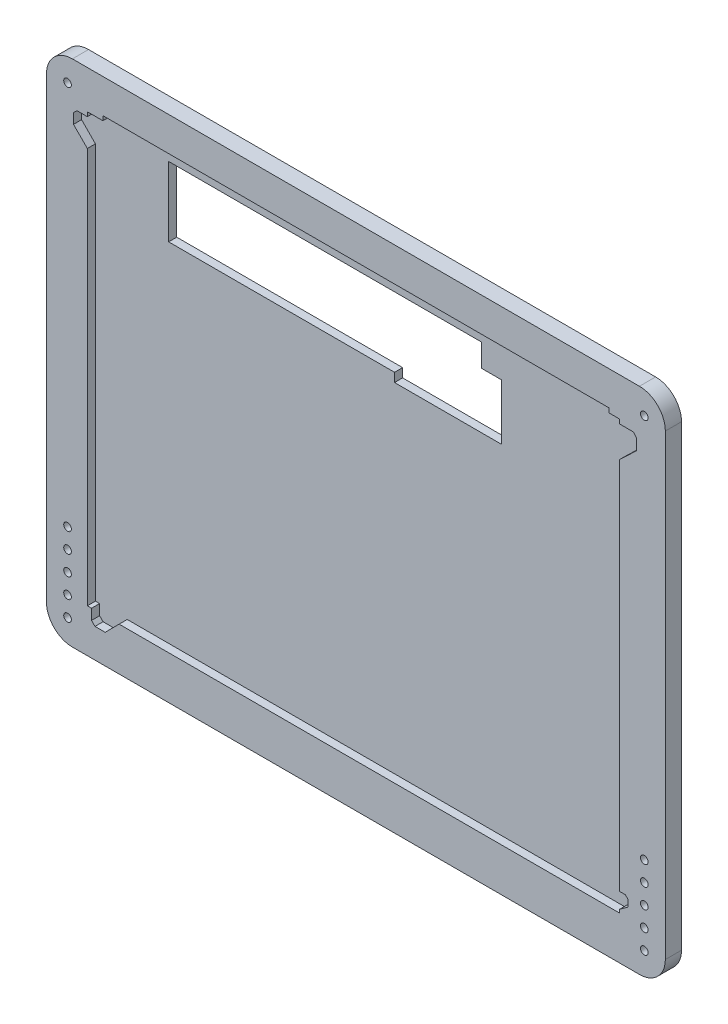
ISO-10303-21;
HEADER;
FILE_DESCRIPTION(('STEP AP214'),'2;1');
FILE_NAME('part.step','',(''),(''),'','','');
FILE_SCHEMA(('AUTOMOTIVE_DESIGN { 1 0 10303 214 1 1 1 1 }'));
ENDSEC;
DATA;
#1=APPLICATION_CONTEXT('core data for automotive mechanical design processes');
#2=APPLICATION_PROTOCOL_DEFINITION('international standard','automotive_design',2000,#1);
#3=PRODUCT_CONTEXT('',#1,'mechanical');
#4=PRODUCT('Part','Part','',(#3));
#5=PRODUCT_RELATED_PRODUCT_CATEGORY('part','',(#4));
#6=PRODUCT_DEFINITION_FORMATION('','',#4);
#7=PRODUCT_DEFINITION_CONTEXT('part definition',#1,'design');
#8=PRODUCT_DEFINITION('design','',#6,#7);
#9=PRODUCT_DEFINITION_SHAPE('','',#8);
#10=(LENGTH_UNIT() NAMED_UNIT(*) SI_UNIT(.MILLI.,.METRE.));
#11=(NAMED_UNIT(*) PLANE_ANGLE_UNIT() SI_UNIT($,.RADIAN.));
#12=(NAMED_UNIT(*) SI_UNIT($,.STERADIAN.) SOLID_ANGLE_UNIT());
#13=UNCERTAINTY_MEASURE_WITH_UNIT(LENGTH_MEASURE(1.E-05),#10,'distance_accuracy_value','');
#14=(GEOMETRIC_REPRESENTATION_CONTEXT(3) GLOBAL_UNCERTAINTY_ASSIGNED_CONTEXT((#13)) GLOBAL_UNIT_ASSIGNED_CONTEXT((#10,
#11,#12)) REPRESENTATION_CONTEXT('',''));
#15=CARTESIAN_POINT('',(0.,0.,0.));
#16=DIRECTION('',(0.,0.,1.));
#17=DIRECTION('',(1.,0.,0.));
#18=AXIS2_PLACEMENT_3D('',#15,#16,#17);
#19=CARTESIAN_POINT('',(291.850021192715,174.966376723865,3.175));
#20=DIRECTION('',(0.,1.,0.));
#21=DIRECTION('',(0.,0.,1.));
#22=AXIS2_PLACEMENT_3D('',#19,#20,#21);
#23=PLANE('',#22);
#24=DIRECTION('',(-1.,0.,0.));
#25=VECTOR('',#24,1.);
#26=CARTESIAN_POINT('',(291.850021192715,174.966376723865,6.35));
#27=LINE('',#26,#25);
#28=CARTESIAN_POINT('',(500.851381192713,174.966376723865,6.35));
#29=VERTEX_POINT('',#28);
#30=CARTESIAN_POINT('',(496.656247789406,174.966376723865,6.35));
#31=VERTEX_POINT('',#30);
#32=EDGE_CURVE('E486',#29,#31,#27,.T.);
#33=ORIENTED_EDGE('',*,*,#32,.T.);
#34=DIRECTION('',(0.,0.,-1.));
#35=VECTOR('',#34,1.);
#36=CARTESIAN_POINT('',(496.656247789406,174.966376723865,3.175));
#37=LINE('',#36,#35);
#38=CARTESIAN_POINT('',(496.656247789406,174.966376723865,3.175));
#39=VERTEX_POINT('',#38);
#40=EDGE_CURVE('E357',#31,#39,#37,.T.);
#41=ORIENTED_EDGE('',*,*,#40,.T.);
#42=DIRECTION('',(-1.,0.,0.));
#43=VECTOR('',#42,1.);
#44=CARTESIAN_POINT('',(291.850021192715,174.966376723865,3.175));
#45=LINE('',#44,#43);
#46=CARTESIAN_POINT('',(500.851381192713,174.966376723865,3.175));
#47=VERTEX_POINT('',#46);
#48=EDGE_CURVE('E330',#47,#39,#45,.T.);
#49=ORIENTED_EDGE('',*,*,#48,.F.);
#50=DIRECTION('',(0.,0.,1.));
#51=VECTOR('',#50,1.);
#52=CARTESIAN_POINT('',(500.851381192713,174.966376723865,3.175));
#53=LINE('',#52,#51);
#54=EDGE_CURVE('E629',#47,#29,#53,.T.);
#55=ORIENTED_EDGE('',*,*,#54,.T.);
#56=EDGE_LOOP('',(#33,#41,#49,#55));
#57=FACE_BOUND('',#56,.T.);
#58=ADVANCED_FACE('F43',(#57),#23,.F.);
#59=CARTESIAN_POINT('',(285.971860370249,0.147179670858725,6.35));
#60=DIRECTION('',(0.,0.,-1.));
#61=DIRECTION('',(-1.,0.,0.));
#62=AXIS2_PLACEMENT_3D('',#59,#60,#61);
#63=CYLINDRICAL_SURFACE('',#62,10.16);
#64=CARTESIAN_POINT('',(285.971860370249,0.147179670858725,0.));
#65=DIRECTION('',(0.,0.,1.));
#66=DIRECTION('',(1.,0.,0.));
#67=AXIS2_PLACEMENT_3D('',#64,#65,#66);
#68=CIRCLE('',#67,10.16);
#69=CARTESIAN_POINT('',(275.811860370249,0.147179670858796,0.));
#70=VERTEX_POINT('',#69);
#71=CARTESIAN_POINT('',(285.971860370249,-10.0128203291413,0.));
#72=VERTEX_POINT('',#71);
#73=EDGE_CURVE('E628',#70,#72,#68,.T.);
#74=ORIENTED_EDGE('',*,*,#73,.T.);
#75=DIRECTION('',(0.,0.,-1.));
#76=VECTOR('',#75,1.);
#77=CARTESIAN_POINT('',(285.971860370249,-10.0128203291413,6.35));
#78=LINE('',#77,#76);
#79=CARTESIAN_POINT('',(285.971860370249,-10.0128203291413,6.35));
#80=VERTEX_POINT('',#79);
#81=EDGE_CURVE('E730',#80,#72,#78,.T.);
#82=ORIENTED_EDGE('',*,*,#81,.F.);
#83=CARTESIAN_POINT('',(285.971860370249,0.147179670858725,6.35));
#84=DIRECTION('',(0.,0.,1.));
#85=DIRECTION('',(1.,0.,0.));
#86=AXIS2_PLACEMENT_3D('',#83,#84,#85);
#87=CIRCLE('',#86,10.16);
#88=CARTESIAN_POINT('',(275.811860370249,0.147179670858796,6.35));
#89=VERTEX_POINT('',#88);
#90=EDGE_CURVE('E675',#89,#80,#87,.T.);
#91=ORIENTED_EDGE('',*,*,#90,.F.);
#92=DIRECTION('',(0.,0.,-1.));
#93=VECTOR('',#92,1.);
#94=CARTESIAN_POINT('',(275.811860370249,0.147179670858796,6.35));
#95=LINE('',#94,#93);
#96=EDGE_CURVE('E694',#89,#70,#95,.T.);
#97=ORIENTED_EDGE('',*,*,#96,.T.);
#98=EDGE_LOOP('',(#74,#82,#91,#97));
#99=FACE_BOUND('',#98,.T.);
#100=ADVANCED_FACE('F45',(#99),#63,.T.);
#101=CARTESIAN_POINT('',(285.971860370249,-10.0128203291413,6.35));
#102=DIRECTION('',(0.,1.,0.));
#103=DIRECTION('',(0.,0.,1.));
#104=AXIS2_PLACEMENT_3D('',#101,#102,#103);
#105=PLANE('',#104);
#106=DIRECTION('',(1.,0.,0.));
#107=VECTOR('',#106,1.);
#108=CARTESIAN_POINT('',(285.971860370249,-10.0128203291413,0.));
#109=LINE('',#108,#107);
#110=CARTESIAN_POINT('',(508.635031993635,-10.0128203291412,0.));
#111=VERTEX_POINT('',#110);
#112=EDGE_CURVE('E697',#72,#111,#109,.T.);
#113=ORIENTED_EDGE('',*,*,#112,.T.);
#114=DIRECTION('',(0.,0.,-1.));
#115=VECTOR('',#114,1.);
#116=CARTESIAN_POINT('',(508.635031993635,-10.0128203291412,6.35));
#117=LINE('',#116,#115);
#118=CARTESIAN_POINT('',(508.635031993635,-10.0128203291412,6.35));
#119=VERTEX_POINT('',#118);
#120=EDGE_CURVE('E727',#119,#111,#117,.T.);
#121=ORIENTED_EDGE('',*,*,#120,.F.);
#122=DIRECTION('',(1.,0.,0.));
#123=VECTOR('',#122,1.);
#124=CARTESIAN_POINT('',(285.971860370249,-10.0128203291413,6.35));
#125=LINE('',#124,#123);
#126=EDGE_CURVE('E678',#80,#119,#125,.T.);
#127=ORIENTED_EDGE('',*,*,#126,.F.);
#128=ORIENTED_EDGE('',*,*,#81,.T.);
#129=EDGE_LOOP('',(#113,#121,#127,#128));
#130=FACE_BOUND('',#129,.T.);
#131=ADVANCED_FACE('F793',(#130),#105,.F.);
#132=CARTESIAN_POINT('',(508.635031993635,0.147179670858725,6.35));
#133=DIRECTION('',(0.,0.,-1.));
#134=DIRECTION('',(-1.,0.,0.));
#135=AXIS2_PLACEMENT_3D('',#132,#133,#134);
#136=CYLINDRICAL_SURFACE('',#135,10.16);
#137=CARTESIAN_POINT('',(508.635031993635,0.147179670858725,0.));
#138=DIRECTION('',(0.,0.,1.));
#139=DIRECTION('',(1.,0.,0.));
#140=AXIS2_PLACEMENT_3D('',#137,#138,#139);
#141=CIRCLE('',#140,10.16);
#142=CARTESIAN_POINT('',(518.795031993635,0.147179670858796,0.));
#143=VERTEX_POINT('',#142);
#144=EDGE_CURVE('E699',#111,#143,#141,.T.);
#145=ORIENTED_EDGE('',*,*,#144,.T.);
#146=DIRECTION('',(0.,0.,-1.));
#147=VECTOR('',#146,1.);
#148=CARTESIAN_POINT('',(518.795031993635,0.147179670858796,6.35));
#149=LINE('',#148,#147);
#150=CARTESIAN_POINT('',(518.795031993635,0.147179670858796,6.35));
#151=VERTEX_POINT('',#150);
#152=EDGE_CURVE('E724',#151,#143,#149,.T.);
#153=ORIENTED_EDGE('',*,*,#152,.F.);
#154=CARTESIAN_POINT('',(508.635031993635,0.147179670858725,6.35));
#155=DIRECTION('',(0.,0.,1.));
#156=DIRECTION('',(1.,0.,0.));
#157=AXIS2_PLACEMENT_3D('',#154,#155,#156);
#158=CIRCLE('',#157,10.16);
#159=EDGE_CURVE('E681',#119,#151,#158,.T.);
#160=ORIENTED_EDGE('',*,*,#159,.F.);
#161=ORIENTED_EDGE('',*,*,#120,.T.);
#162=EDGE_LOOP('',(#145,#153,#160,#161));
#163=FACE_BOUND('',#162,.T.);
#164=ADVANCED_FACE('F1370',(#163),#136,.T.);
#165=CARTESIAN_POINT('',(518.795031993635,179.855000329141,6.35));
#166=DIRECTION('',(-1.,0.,0.));
#167=DIRECTION('',(0.,0.,1.));
#168=AXIS2_PLACEMENT_3D('',#165,#166,#167);
#169=PLANE('',#168);
#170=DIRECTION('',(0.,1.,0.));
#171=VECTOR('',#170,1.);
#172=CARTESIAN_POINT('',(518.795031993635,179.855000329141,0.));
#173=LINE('',#172,#171);
#174=CARTESIAN_POINT('',(518.795031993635,179.855000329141,0.));
#175=VERTEX_POINT('',#174);
#176=EDGE_CURVE('E701',#143,#175,#173,.T.);
#177=ORIENTED_EDGE('',*,*,#176,.T.);
#178=DIRECTION('',(0.,0.,-1.));
#179=VECTOR('',#178,1.);
#180=CARTESIAN_POINT('',(518.795031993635,179.855000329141,6.35));
#181=LINE('',#180,#179);
#182=CARTESIAN_POINT('',(518.795031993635,179.855000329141,6.35));
#183=VERTEX_POINT('',#182);
#184=EDGE_CURVE('E721',#183,#175,#181,.T.);
#185=ORIENTED_EDGE('',*,*,#184,.F.);
#186=DIRECTION('',(0.,1.,0.));
#187=VECTOR('',#186,1.);
#188=CARTESIAN_POINT('',(518.795031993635,179.855000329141,6.35));
#189=LINE('',#188,#187);
#190=EDGE_CURVE('E683',#151,#183,#189,.T.);
#191=ORIENTED_EDGE('',*,*,#190,.F.);
#192=ORIENTED_EDGE('',*,*,#152,.T.);
#193=EDGE_LOOP('',(#177,#185,#191,#192));
#194=FACE_BOUND('',#193,.T.);
#195=ADVANCED_FACE('F1360',(#194),#169,.F.);
#196=CARTESIAN_POINT('',(508.635031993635,179.855000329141,6.35));
#197=DIRECTION('',(0.,0.,-1.));
#198=DIRECTION('',(-1.,0.,0.));
#199=AXIS2_PLACEMENT_3D('',#196,#197,#198);
#200=CYLINDRICAL_SURFACE('',#199,10.16);
#201=CARTESIAN_POINT('',(508.635031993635,179.855000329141,0.));
#202=DIRECTION('',(0.,0.,1.));
#203=DIRECTION('',(-1.,0.,0.));
#204=AXIS2_PLACEMENT_3D('',#201,#202,#203);
#205=CIRCLE('',#204,10.16);
#206=CARTESIAN_POINT('',(508.635031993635,190.015000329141,0.));
#207=VERTEX_POINT('',#206);
#208=EDGE_CURVE('E703',#175,#207,#205,.T.);
#209=ORIENTED_EDGE('',*,*,#208,.T.);
#210=DIRECTION('',(0.,0.,-1.));
#211=VECTOR('',#210,1.);
#212=CARTESIAN_POINT('',(508.635031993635,190.015000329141,6.35));
#213=LINE('',#212,#211);
#214=CARTESIAN_POINT('',(508.635031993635,190.015000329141,6.35));
#215=VERTEX_POINT('',#214);
#216=EDGE_CURVE('E718',#215,#207,#213,.T.);
#217=ORIENTED_EDGE('',*,*,#216,.F.);
#218=CARTESIAN_POINT('',(508.635031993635,179.855000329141,6.35));
#219=DIRECTION('',(0.,0.,1.));
#220=DIRECTION('',(-1.,0.,0.));
#221=AXIS2_PLACEMENT_3D('',#218,#219,#220);
#222=CIRCLE('',#221,10.16);
#223=EDGE_CURVE('E685',#183,#215,#222,.T.);
#224=ORIENTED_EDGE('',*,*,#223,.F.);
#225=ORIENTED_EDGE('',*,*,#184,.T.);
#226=EDGE_LOOP('',(#209,#217,#224,#225));
#227=FACE_BOUND('',#226,.T.);
#228=ADVANCED_FACE('F1350',(#227),#200,.T.);
#229=CARTESIAN_POINT('',(285.971860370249,190.015000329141,6.35));
#230=DIRECTION('',(0.,-1.,0.));
#231=DIRECTION('',(0.,0.,-1.));
#232=AXIS2_PLACEMENT_3D('',#229,#230,#231);
#233=PLANE('',#232);
#234=DIRECTION('',(-1.,0.,0.));
#235=VECTOR('',#234,1.);
#236=CARTESIAN_POINT('',(285.971860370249,190.015000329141,0.));
#237=LINE('',#236,#235);
#238=CARTESIAN_POINT('',(285.971860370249,190.015000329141,0.));
#239=VERTEX_POINT('',#238);
#240=EDGE_CURVE('E705',#207,#239,#237,.T.);
#241=ORIENTED_EDGE('',*,*,#240,.T.);
#242=DIRECTION('',(0.,0.,-1.));
#243=VECTOR('',#242,1.);
#244=CARTESIAN_POINT('',(285.971860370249,190.015000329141,6.35));
#245=LINE('',#244,#243);
#246=CARTESIAN_POINT('',(285.971860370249,190.015000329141,6.35));
#247=VERTEX_POINT('',#246);
#248=EDGE_CURVE('E715',#247,#239,#245,.T.);
#249=ORIENTED_EDGE('',*,*,#248,.F.);
#250=DIRECTION('',(-1.,0.,0.));
#251=VECTOR('',#250,1.);
#252=CARTESIAN_POINT('',(285.971860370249,190.015000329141,6.35));
#253=LINE('',#252,#251);
#254=EDGE_CURVE('E687',#215,#247,#253,.T.);
#255=ORIENTED_EDGE('',*,*,#254,.F.);
#256=ORIENTED_EDGE('',*,*,#216,.T.);
#257=EDGE_LOOP('',(#241,#249,#255,#256));
#258=FACE_BOUND('',#257,.T.);
#259=ADVANCED_FACE('F1340',(#258),#233,.F.);
#260=CARTESIAN_POINT('',(285.971860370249,179.855000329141,6.35));
#261=DIRECTION('',(0.,0.,-1.));
#262=DIRECTION('',(-1.,0.,0.));
#263=AXIS2_PLACEMENT_3D('',#260,#261,#262);
#264=CYLINDRICAL_SURFACE('',#263,10.16);
#265=CARTESIAN_POINT('',(285.971860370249,179.855000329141,0.));
#266=DIRECTION('',(0.,0.,1.));
#267=DIRECTION('',(1.,0.,0.));
#268=AXIS2_PLACEMENT_3D('',#265,#266,#267);
#269=CIRCLE('',#268,10.16);
#270=CARTESIAN_POINT('',(275.811860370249,179.855000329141,0.));
#271=VERTEX_POINT('',#270);
#272=EDGE_CURVE('E707',#239,#271,#269,.T.);
#273=ORIENTED_EDGE('',*,*,#272,.T.);
#274=DIRECTION('',(0.,0.,-1.));
#275=VECTOR('',#274,1.);
#276=CARTESIAN_POINT('',(275.811860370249,179.855000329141,6.35));
#277=LINE('',#276,#275);
#278=CARTESIAN_POINT('',(275.811860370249,179.855000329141,6.35));
#279=VERTEX_POINT('',#278);
#280=EDGE_CURVE('E712',#279,#271,#277,.T.);
#281=ORIENTED_EDGE('',*,*,#280,.F.);
#282=CARTESIAN_POINT('',(285.971860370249,179.855000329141,6.35));
#283=DIRECTION('',(0.,0.,1.));
#284=DIRECTION('',(1.,0.,0.));
#285=AXIS2_PLACEMENT_3D('',#282,#283,#284);
#286=CIRCLE('',#285,10.16);
#287=EDGE_CURVE('E689',#247,#279,#286,.T.);
#288=ORIENTED_EDGE('',*,*,#287,.F.);
#289=ORIENTED_EDGE('',*,*,#248,.T.);
#290=EDGE_LOOP('',(#273,#281,#288,#289));
#291=FACE_BOUND('',#290,.T.);
#292=ADVANCED_FACE('F1330',(#291),#264,.T.);
#293=CARTESIAN_POINT('',(275.811860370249,179.855000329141,6.35));
#294=DIRECTION('',(1.,0.,0.));
#295=DIRECTION('',(0.,0.,-1.));
#296=AXIS2_PLACEMENT_3D('',#293,#294,#295);
#297=PLANE('',#296);
#298=DIRECTION('',(0.,-1.,0.));
#299=VECTOR('',#298,1.);
#300=CARTESIAN_POINT('',(275.811860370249,179.855000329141,0.));
#301=LINE('',#300,#299);
#302=EDGE_CURVE('E679',#271,#70,#301,.T.);
#303=ORIENTED_EDGE('',*,*,#302,.T.);
#304=ORIENTED_EDGE('',*,*,#96,.F.);
#305=DIRECTION('',(0.,-1.,0.));
#306=VECTOR('',#305,1.);
#307=CARTESIAN_POINT('',(275.811860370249,179.855000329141,6.35));
#308=LINE('',#307,#306);
#309=EDGE_CURVE('E691',#279,#89,#308,.T.);
#310=ORIENTED_EDGE('',*,*,#309,.F.);
#311=ORIENTED_EDGE('',*,*,#280,.T.);
#312=EDGE_LOOP('',(#303,#304,#310,#311));
#313=FACE_BOUND('',#312,.T.);
#314=ADVANCED_FACE('F977',(#313),#297,.F.);
#315=CARTESIAN_POINT('',(285.971860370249,0.147179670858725,6.35));
#316=DIRECTION('',(0.,0.,1.));
#317=DIRECTION('',(1.,0.,0.));
#318=AXIS2_PLACEMENT_3D('',#315,#316,#317);
#319=PLANE('',#318);
#320=DIRECTION('',(0.,1.,0.));
#321=VECTOR('',#320,1.);
#322=CARTESIAN_POINT('',(496.656247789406,176.697205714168,6.35));
#323=LINE('',#322,#321);
#324=CARTESIAN_POINT('',(496.656247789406,176.697205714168,6.35));
#325=VERTEX_POINT('',#324);
#326=EDGE_CURVE('E339',#31,#325,#323,.T.);
#327=ORIENTED_EDGE('',*,*,#326,.F.);
#328=ORIENTED_EDGE('',*,*,#32,.F.);
#329=DIRECTION('',(0.,1.,0.));
#330=VECTOR('',#329,1.);
#331=CARTESIAN_POINT('',(500.851381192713,174.966376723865,6.35));
#332=LINE('',#331,#330);
#333=CARTESIAN_POINT('',(500.851381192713,173.289969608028,6.35));
#334=VERTEX_POINT('',#333);
#335=EDGE_CURVE('E618',#334,#29,#332,.T.);
#336=ORIENTED_EDGE('',*,*,#335,.F.);
#337=DIRECTION('',(-1.,0.,0.));
#338=VECTOR('',#337,1.);
#339=CARTESIAN_POINT('',(500.851381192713,173.289969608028,6.35));
#340=LINE('',#339,#338);
#341=CARTESIAN_POINT('',(506.254962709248,173.289969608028,6.35));
#342=VERTEX_POINT('',#341);
#343=EDGE_CURVE('E615',#342,#334,#340,.T.);
#344=ORIENTED_EDGE('',*,*,#343,.F.);
#345=DIRECTION('',(-0.649866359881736,0.760048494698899,0.));
#346=VECTOR('',#345,1.);
#347=CARTESIAN_POINT('',(506.254962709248,173.289969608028,6.35));
#348=LINE('',#347,#346);
#349=CARTESIAN_POINT('',(507.386455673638,171.966636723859,6.35));
#350=VERTEX_POINT('',#349);
#351=EDGE_CURVE('E612',#350,#342,#348,.T.);
#352=ORIENTED_EDGE('',*,*,#351,.F.);
#353=DIRECTION('',(0.,1.,0.));
#354=VECTOR('',#353,1.);
#355=CARTESIAN_POINT('',(507.386455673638,171.966636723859,6.35));
#356=LINE('',#355,#354);
#357=CARTESIAN_POINT('',(507.386455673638,167.404390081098,6.35));
#358=VERTEX_POINT('',#357);
#359=EDGE_CURVE('E609',#358,#350,#356,.T.);
#360=ORIENTED_EDGE('',*,*,#359,.F.);
#361=DIRECTION('',(0.725667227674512,0.688045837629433,0.));
#362=VECTOR('',#361,1.);
#363=CARTESIAN_POINT('',(507.386455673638,167.404390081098,6.35));
#364=LINE('',#363,#362);
#365=CARTESIAN_POINT('',(500.851381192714,161.208119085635,6.35));
#366=VERTEX_POINT('',#365);
#367=EDGE_CURVE('E606',#366,#358,#364,.T.);
#368=ORIENTED_EDGE('',*,*,#367,.F.);
#369=DIRECTION('',(0.,1.,0.));
#370=VECTOR('',#369,1.);
#371=CARTESIAN_POINT('',(500.851381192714,161.208119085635,6.35));
#372=LINE('',#371,#370);
#373=CARTESIAN_POINT('',(500.851381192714,14.3413138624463,6.35));
#374=VERTEX_POINT('',#373);
#375=EDGE_CURVE('E603',#374,#366,#372,.T.);
#376=ORIENTED_EDGE('',*,*,#375,.F.);
#377=DIRECTION('',(-1.,0.,0.));
#378=VECTOR('',#377,1.);
#379=CARTESIAN_POINT('',(500.851381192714,14.3413138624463,6.35));
#380=LINE('',#379,#378);
#381=CARTESIAN_POINT('',(503.117775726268,14.3413138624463,6.35));
#382=VERTEX_POINT('',#381);
#383=EDGE_CURVE('E600',#382,#374,#380,.T.);
#384=ORIENTED_EDGE('',*,*,#383,.F.);
#385=DIRECTION('',(-0.697354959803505,0.716725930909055,0.));
#386=VECTOR('',#385,1.);
#387=CARTESIAN_POINT('',(503.117775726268,14.3413138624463,6.35));
#388=LINE('',#387,#386);
#389=CARTESIAN_POINT('',(504.237895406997,13.190079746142,6.35));
#390=VERTEX_POINT('',#389);
#391=EDGE_CURVE('E597',#390,#382,#388,.T.);
#392=ORIENTED_EDGE('',*,*,#391,.F.);
#393=DIRECTION('',(0.,1.,0.));
#394=VECTOR('',#393,1.);
#395=CARTESIAN_POINT('',(504.237895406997,13.190079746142,6.35));
#396=LINE('',#395,#394);
#397=CARTESIAN_POINT('',(504.237895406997,10.7320393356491,6.35));
#398=VERTEX_POINT('',#397);
#399=EDGE_CURVE('E594',#398,#390,#396,.T.);
#400=ORIENTED_EDGE('',*,*,#399,.F.);
#401=DIRECTION('',(0.8092903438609,0.587408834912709,0.));
#402=VECTOR('',#401,1.);
#403=CARTESIAN_POINT('',(504.237895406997,10.7320393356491,6.35));
#404=LINE('',#403,#402);
#405=CARTESIAN_POINT('',(500.851381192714,8.27399892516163,6.35));
#406=VERTEX_POINT('',#405);
#407=EDGE_CURVE('E591',#406,#398,#404,.T.);
#408=ORIENTED_EDGE('',*,*,#407,.F.);
#409=DIRECTION('',(0.,1.,0.));
#410=VECTOR('',#409,1.);
#411=CARTESIAN_POINT('',(500.851381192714,8.27399892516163,6.35));
#412=LINE('',#411,#410);
#413=CARTESIAN_POINT('',(500.851381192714,6.96569672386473,6.35));
#414=VERTEX_POINT('',#413);
#415=EDGE_CURVE('E588',#414,#406,#412,.T.);
#416=ORIENTED_EDGE('',*,*,#415,.F.);
#417=DIRECTION('',(1.,0.,0.));
#418=VECTOR('',#417,1.);
#419=CARTESIAN_POINT('',(500.851381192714,6.96569672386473,6.35));
#420=LINE('',#419,#418);
#421=CARTESIAN_POINT('',(304.324968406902,6.96569672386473,6.35));
#422=VERTEX_POINT('',#421);
#423=EDGE_CURVE('E584',#422,#414,#420,.T.);
#424=ORIENTED_EDGE('',*,*,#423,.F.);
#425=DIRECTION('',(0.704846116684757,0.709360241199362,0.));
#426=VECTOR('',#425,1.);
#427=CARTESIAN_POINT('',(304.324968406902,6.96569672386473,6.35));
#428=LINE('',#427,#426);
#429=CARTESIAN_POINT('',(298.850261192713,1.45592723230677,6.35));
#430=VERTEX_POINT('',#429);
#431=EDGE_CURVE('E581',#430,#422,#428,.T.);
#432=ORIENTED_EDGE('',*,*,#431,.F.);
#433=DIRECTION('',(1.,0.,0.));
#434=VECTOR('',#433,1.);
#435=CARTESIAN_POINT('',(298.850261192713,1.45592723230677,6.35));
#436=LINE('',#435,#434);
#437=CARTESIAN_POINT('',(294.849761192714,1.45592723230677,6.35));
#438=VERTEX_POINT('',#437);
#439=EDGE_CURVE('E578',#438,#430,#436,.T.);
#440=ORIENTED_EDGE('',*,*,#439,.F.);
#441=DIRECTION('',(0.709360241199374,-0.704846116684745,0.));
#442=VECTOR('',#441,1.);
#443=CARTESIAN_POINT('',(294.849761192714,1.45592723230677,6.35));
#444=LINE('',#443,#442);
#445=CARTESIAN_POINT('',(293.485330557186,2.81167510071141,6.35));
#446=VERTEX_POINT('',#445);
#447=EDGE_CURVE('E575',#446,#438,#444,.T.);
#448=ORIENTED_EDGE('',*,*,#447,.F.);
#449=DIRECTION('',(0.,-1.,0.));
#450=VECTOR('',#449,1.);
#451=CARTESIAN_POINT('',(293.485330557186,2.81167510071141,6.35));
#452=LINE('',#451,#450);
#453=CARTESIAN_POINT('',(293.485330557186,6.96569672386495,6.35));
#454=VERTEX_POINT('',#453);
#455=EDGE_CURVE('E572',#454,#446,#452,.T.);
#456=ORIENTED_EDGE('',*,*,#455,.F.);
#457=DIRECTION('',(1.,0.,0.));
#458=VECTOR('',#457,1.);
#459=CARTESIAN_POINT('',(293.485330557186,6.96569672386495,6.35));
#460=LINE('',#459,#458);
#461=CARTESIAN_POINT('',(291.850021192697,6.96569672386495,6.35));
#462=VERTEX_POINT('',#461);
#463=EDGE_CURVE('E569',#462,#454,#460,.T.);
#464=ORIENTED_EDGE('',*,*,#463,.F.);
#465=DIRECTION('',(0.,-1.,0.));
#466=VECTOR('',#465,1.);
#467=CARTESIAN_POINT('',(291.850021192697,6.96569672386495,6.35));
#468=LINE('',#467,#466);
#469=CARTESIAN_POINT('',(291.850021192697,162.470783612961,6.35));
#470=VERTEX_POINT('',#469);
#471=EDGE_CURVE('E566',#470,#462,#468,.T.);
#472=ORIENTED_EDGE('',*,*,#471,.F.);
#473=DIRECTION('',(0.703517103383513,-0.710678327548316,0.));
#474=VECTOR('',#473,1.);
#475=CARTESIAN_POINT('',(286.410042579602,167.966136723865,6.35));
#476=LINE('',#475,#474);
#477=CARTESIAN_POINT('',(286.410042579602,167.966136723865,6.35));
#478=VERTEX_POINT('',#477);
#479=EDGE_CURVE('E563',#478,#470,#476,.T.);
#480=ORIENTED_EDGE('',*,*,#479,.F.);
#481=DIRECTION('',(0.,-1.,0.));
#482=VECTOR('',#481,1.);
#483=CARTESIAN_POINT('',(286.410042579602,171.966636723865,6.35));
#484=LINE('',#483,#482);
#485=CARTESIAN_POINT('',(286.410042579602,171.966636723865,6.35));
#486=VERTEX_POINT('',#485);
#487=EDGE_CURVE('E560',#486,#478,#484,.T.);
#488=ORIENTED_EDGE('',*,*,#487,.F.);
#489=DIRECTION('',(-0.736776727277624,-0.676136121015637,0.));
#490=VECTOR('',#489,1.);
#491=CARTESIAN_POINT('',(287.852061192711,173.289969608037,6.35));
#492=LINE('',#491,#490);
#493=CARTESIAN_POINT('',(287.852061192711,173.289969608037,6.35));
#494=VERTEX_POINT('',#493);
#495=EDGE_CURVE('E557',#494,#486,#492,.T.);
#496=ORIENTED_EDGE('',*,*,#495,.F.);
#497=DIRECTION('',(-1.,0.,0.));
#498=VECTOR('',#497,1.);
#499=CARTESIAN_POINT('',(291.850021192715,173.289969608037,6.35));
#500=LINE('',#499,#498);
#501=CARTESIAN_POINT('',(291.850021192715,173.289969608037,6.35));
#502=VERTEX_POINT('',#501);
#503=EDGE_CURVE('E554',#502,#494,#500,.T.);
#504=ORIENTED_EDGE('',*,*,#503,.F.);
#505=DIRECTION('',(0.,-1.,0.));
#506=VECTOR('',#505,1.);
#507=CARTESIAN_POINT('',(291.850021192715,173.289969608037,6.35));
#508=LINE('',#507,#506);
#509=CARTESIAN_POINT('',(291.850021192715,174.966376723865,6.35));
#510=VERTEX_POINT('',#509);
#511=EDGE_CURVE('E478',#510,#502,#508,.T.);
#512=ORIENTED_EDGE('',*,*,#511,.F.);
#513=CARTESIAN_POINT('',(297.950644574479,174.966376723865,6.35));
#514=VERTEX_POINT('',#513);
#515=EDGE_CURVE('E621',#514,#510,#27,.T.);
#516=ORIENTED_EDGE('',*,*,#515,.F.);
#517=DIRECTION('',(0.,-1.,0.));
#518=VECTOR('',#517,1.);
#519=CARTESIAN_POINT('',(297.950644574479,176.697205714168,6.35));
#520=LINE('',#519,#518);
#521=CARTESIAN_POINT('',(297.950644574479,176.697205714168,6.35));
#522=VERTEX_POINT('',#521);
#523=EDGE_CURVE('E333',#522,#514,#520,.T.);
#524=ORIENTED_EDGE('',*,*,#523,.F.);
#525=DIRECTION('',(-1.,0.,0.));
#526=VECTOR('',#525,1.);
#527=CARTESIAN_POINT('',(297.950644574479,176.697205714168,6.35));
#528=LINE('',#527,#526);
#529=EDGE_CURVE('E350',#325,#522,#528,.T.);
#530=ORIENTED_EDGE('',*,*,#529,.F.);
#531=EDGE_LOOP('',(#327,#328,#336,#344,#352,#360,#368,#376,#384,#392,#400,#408,#416,#424,#432,
#440,#448,#456,#464,#472,#480,#488,#496,#504,#512,#516,#524,#530));
#532=FACE_BOUND('',#531,.T.);
#533=CARTESIAN_POINT('',(510.536038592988,6.79250143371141,6.35));
#534=DIRECTION('',(0.,0.,1.));
#535=DIRECTION('',(-1.,0.,0.));
#536=AXIS2_PLACEMENT_3D('',#533,#534,#535);
#537=CIRCLE('',#536,1.50000000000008);
#538=CARTESIAN_POINT('',(509.036038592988,6.79250143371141,6.35));
#539=VERTEX_POINT('',#538);
#540=EDGE_CURVE('E384',#539,#539,#537,.T.);
#541=ORIENTED_EDGE('',*,*,#540,.F.);
#542=EDGE_LOOP('',(#541));
#543=FACE_BOUND('',#542,.T.);
#544=CARTESIAN_POINT('',(510.536038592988,14.5029424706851,6.35));
#545=DIRECTION('',(0.,0.,1.));
#546=DIRECTION('',(-1.,0.,0.));
#547=AXIS2_PLACEMENT_3D('',#544,#545,#546);
#548=CIRCLE('',#547,1.50000000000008);
#549=CARTESIAN_POINT('',(509.036038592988,14.5029424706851,6.35));
#550=VERTEX_POINT('',#549);
#551=EDGE_CURVE('E401',#550,#550,#548,.T.);
#552=ORIENTED_EDGE('',*,*,#551,.F.);
#553=EDGE_LOOP('',(#552));
#554=FACE_BOUND('',#553,.T.);
#555=CARTESIAN_POINT('',(510.536038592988,22.2133835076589,6.35));
#556=DIRECTION('',(0.,0.,1.));
#557=DIRECTION('',(-1.,0.,0.));
#558=AXIS2_PLACEMENT_3D('',#555,#556,#557);
#559=CIRCLE('',#558,1.50000000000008);
#560=CARTESIAN_POINT('',(509.036038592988,22.2133835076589,6.35));
#561=VERTEX_POINT('',#560);
#562=EDGE_CURVE('E408',#561,#561,#559,.T.);
#563=ORIENTED_EDGE('',*,*,#562,.F.);
#564=EDGE_LOOP('',(#563));
#565=FACE_BOUND('',#564,.T.);
#566=CARTESIAN_POINT('',(510.536038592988,29.9238245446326,6.35));
#567=DIRECTION('',(0.,0.,1.));
#568=DIRECTION('',(-1.,0.,0.));
#569=AXIS2_PLACEMENT_3D('',#566,#567,#568);
#570=CIRCLE('',#569,1.50000000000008);
#571=CARTESIAN_POINT('',(509.036038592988,29.9238245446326,6.35));
#572=VERTEX_POINT('',#571);
#573=EDGE_CURVE('E415',#572,#572,#570,.T.);
#574=ORIENTED_EDGE('',*,*,#573,.F.);
#575=EDGE_LOOP('',(#574));
#576=FACE_BOUND('',#575,.T.);
#577=CARTESIAN_POINT('',(284.070853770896,29.9238245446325,6.35));
#578=DIRECTION('',(0.,0.,1.));
#579=DIRECTION('',(1.,0.,0.));
#580=AXIS2_PLACEMENT_3D('',#577,#578,#579);
#581=CIRCLE('',#580,1.50000000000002);
#582=CARTESIAN_POINT('',(285.570853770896,29.9238245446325,6.35));
#583=VERTEX_POINT('',#582);
#584=EDGE_CURVE('E422',#583,#583,#581,.T.);
#585=ORIENTED_EDGE('',*,*,#584,.F.);
#586=EDGE_LOOP('',(#585));
#587=FACE_BOUND('',#586,.T.);
#588=CARTESIAN_POINT('',(284.070853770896,22.2133835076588,6.35));
#589=DIRECTION('',(0.,0.,1.));
#590=DIRECTION('',(1.,0.,0.));
#591=AXIS2_PLACEMENT_3D('',#588,#589,#590);
#592=CIRCLE('',#591,1.50000000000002);
#593=CARTESIAN_POINT('',(285.570853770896,22.2133835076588,6.35));
#594=VERTEX_POINT('',#593);
#595=EDGE_CURVE('E429',#594,#594,#592,.T.);
#596=ORIENTED_EDGE('',*,*,#595,.F.);
#597=EDGE_LOOP('',(#596));
#598=FACE_BOUND('',#597,.T.);
#599=CARTESIAN_POINT('',(284.070853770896,14.502942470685,6.35));
#600=DIRECTION('',(0.,0.,1.));
#601=DIRECTION('',(1.,0.,0.));
#602=AXIS2_PLACEMENT_3D('',#599,#600,#601);
#603=CIRCLE('',#602,1.49999999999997);
#604=CARTESIAN_POINT('',(285.570853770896,14.502942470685,6.35));
#605=VERTEX_POINT('',#604);
#606=EDGE_CURVE('E436',#605,#605,#603,.T.);
#607=ORIENTED_EDGE('',*,*,#606,.F.);
#608=EDGE_LOOP('',(#607));
#609=FACE_BOUND('',#608,.T.);
#610=CARTESIAN_POINT('',(284.070853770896,6.7925014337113,6.35));
#611=DIRECTION('',(0.,0.,1.));
#612=DIRECTION('',(1.,0.,0.));
#613=AXIS2_PLACEMENT_3D('',#610,#611,#612);
#614=CIRCLE('',#613,1.50000000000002);
#615=CARTESIAN_POINT('',(285.570853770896,6.7925014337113,6.35));
#616=VERTEX_POINT('',#615);
#617=EDGE_CURVE('E443',#616,#616,#614,.T.);
#618=ORIENTED_EDGE('',*,*,#617,.F.);
#619=EDGE_LOOP('',(#618));
#620=FACE_BOUND('',#619,.T.);
#621=CARTESIAN_POINT('',(284.070853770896,-0.917939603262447,6.35));
#622=DIRECTION('',(0.,0.,1.));
#623=DIRECTION('',(-1.,0.,0.));
#624=AXIS2_PLACEMENT_3D('',#621,#622,#623);
#625=CIRCLE('',#624,1.49999999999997);
#626=CARTESIAN_POINT('',(282.570853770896,-0.917939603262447,6.35));
#627=VERTEX_POINT('',#626);
#628=EDGE_CURVE('E450',#627,#627,#625,.T.);
#629=ORIENTED_EDGE('',*,*,#628,.F.);
#630=EDGE_LOOP('',(#629));
#631=FACE_BOUND('',#630,.T.);
#632=CARTESIAN_POINT('',(510.536038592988,-0.917939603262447,6.35));
#633=DIRECTION('',(0.,0.,1.));
#634=DIRECTION('',(1.,0.,0.));
#635=AXIS2_PLACEMENT_3D('',#632,#633,#634);
#636=CIRCLE('',#635,1.50000000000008);
#637=CARTESIAN_POINT('',(512.036038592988,-0.917939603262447,6.35));
#638=VERTEX_POINT('',#637);
#639=EDGE_CURVE('E457',#638,#638,#636,.T.);
#640=ORIENTED_EDGE('',*,*,#639,.F.);
#641=EDGE_LOOP('',(#640));
#642=FACE_BOUND('',#641,.T.);
#643=CARTESIAN_POINT('',(510.536038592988,180.920119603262,6.35));
#644=DIRECTION('',(0.,0.,1.));
#645=DIRECTION('',(-1.,0.,0.));
#646=AXIS2_PLACEMENT_3D('',#643,#644,#645);
#647=CIRCLE('',#646,1.50000000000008);
#648=CARTESIAN_POINT('',(509.036038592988,180.920119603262,6.35));
#649=VERTEX_POINT('',#648);
#650=EDGE_CURVE('E464',#649,#649,#647,.T.);
#651=ORIENTED_EDGE('',*,*,#650,.F.);
#652=EDGE_LOOP('',(#651));
#653=FACE_BOUND('',#652,.T.);
#654=CARTESIAN_POINT('',(284.070853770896,180.920119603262,6.35));
#655=DIRECTION('',(0.,0.,1.));
#656=DIRECTION('',(1.,0.,0.));
#657=AXIS2_PLACEMENT_3D('',#654,#655,#656);
#658=CIRCLE('',#657,1.49999999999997);
#659=CARTESIAN_POINT('',(285.570853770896,180.920119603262,6.35));
#660=VERTEX_POINT('',#659);
#661=EDGE_CURVE('E471',#660,#660,#658,.T.);
#662=ORIENTED_EDGE('',*,*,#661,.F.);
#663=EDGE_LOOP('',(#662));
#664=FACE_BOUND('',#663,.T.);
#665=ORIENTED_EDGE('',*,*,#90,.T.);
#666=ORIENTED_EDGE('',*,*,#126,.T.);
#667=ORIENTED_EDGE('',*,*,#159,.T.);
#668=ORIENTED_EDGE('',*,*,#190,.T.);
#669=ORIENTED_EDGE('',*,*,#223,.T.);
#670=ORIENTED_EDGE('',*,*,#254,.T.);
#671=ORIENTED_EDGE('',*,*,#287,.T.);
#672=ORIENTED_EDGE('',*,*,#309,.T.);
#673=EDGE_LOOP('',(#665,#666,#667,#668,#669,#670,#671,#672));
#674=FACE_BOUND('',#673,.T.);
#675=ADVANCED_FACE('F902',(#532,#543,#554,#565,#576,#587,#598,#609,#620,#631,#642,#653,#664,
#674),#319,.T.);
#676=CARTESIAN_POINT('',(285.971860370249,0.147179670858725,0.));
#677=DIRECTION('',(0.,0.,1.));
#678=DIRECTION('',(1.,0.,0.));
#679=AXIS2_PLACEMENT_3D('',#676,#677,#678);
#680=PLANE('',#679);
#681=DIRECTION('',(1.,0.,0.));
#682=VECTOR('',#681,1.);
#683=CARTESIAN_POINT('',(443.535847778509,161.933269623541,0.));
#684=LINE('',#683,#682);
#685=CARTESIAN_POINT('',(443.535847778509,161.933269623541,0.));
#686=VERTEX_POINT('',#685);
#687=CARTESIAN_POINT('',(451.35357404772,161.933269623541,0.));
#688=VERTEX_POINT('',#687);
#689=EDGE_CURVE('E360',#686,#688,#684,.T.);
#690=ORIENTED_EDGE('',*,*,#689,.F.);
#691=DIRECTION('',(0.,-1.,0.));
#692=VECTOR('',#691,1.);
#693=CARTESIAN_POINT('',(443.535847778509,161.933269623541,0.));
#694=LINE('',#693,#692);
#695=CARTESIAN_POINT('',(443.535847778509,170.863631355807,0.));
#696=VERTEX_POINT('',#695);
#697=EDGE_CURVE('E65',#696,#686,#694,.T.);
#698=ORIENTED_EDGE('',*,*,#697,.F.);
#699=DIRECTION('',(1.,0.,0.));
#700=VECTOR('',#699,1.);
#701=CARTESIAN_POINT('',(320.595307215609,170.863631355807,0.));
#702=LINE('',#701,#700);
#703=CARTESIAN_POINT('',(320.595307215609,170.863631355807,0.));
#704=VERTEX_POINT('',#703);
#705=EDGE_CURVE('E378',#704,#696,#702,.T.);
#706=ORIENTED_EDGE('',*,*,#705,.F.);
#707=DIRECTION('',(0.,1.,0.));
#708=VECTOR('',#707,1.);
#709=CARTESIAN_POINT('',(320.595307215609,161.933269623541,0.));
#710=LINE('',#709,#708);
#711=CARTESIAN_POINT('',(320.595307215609,143.510493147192,0.));
#712=VERTEX_POINT('',#711);
#713=EDGE_CURVE('E375',#712,#704,#710,.T.);
#714=ORIENTED_EDGE('',*,*,#713,.F.);
#715=DIRECTION('',(-1.,0.,0.));
#716=VECTOR('',#715,1.);
#717=CARTESIAN_POINT('',(409.291573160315,143.510493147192,0.));
#718=LINE('',#717,#716);
#719=CARTESIAN_POINT('',(409.291573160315,143.510493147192,0.));
#720=VERTEX_POINT('',#719);
#721=EDGE_CURVE('E372',#720,#712,#718,.T.);
#722=ORIENTED_EDGE('',*,*,#721,.F.);
#723=DIRECTION('',(0.,1.,0.));
#724=VECTOR('',#723,1.);
#725=CARTESIAN_POINT('',(409.291573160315,143.510493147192,0.));
#726=LINE('',#725,#724);
#727=CARTESIAN_POINT('',(409.291573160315,140.020912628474,0.));
#728=VERTEX_POINT('',#727);
#729=EDGE_CURVE('E369',#728,#720,#726,.T.);
#730=ORIENTED_EDGE('',*,*,#729,.F.);
#731=DIRECTION('',(-1.,0.,0.));
#732=VECTOR('',#731,1.);
#733=CARTESIAN_POINT('',(409.291573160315,140.020912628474,0.));
#734=LINE('',#733,#732);
#735=CARTESIAN_POINT('',(451.35357404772,140.020912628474,0.));
#736=VERTEX_POINT('',#735);
#737=EDGE_CURVE('E366',#736,#728,#734,.T.);
#738=ORIENTED_EDGE('',*,*,#737,.F.);
#739=DIRECTION('',(0.,-1.,0.));
#740=VECTOR('',#739,1.);
#741=CARTESIAN_POINT('',(451.35357404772,161.933269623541,0.));
#742=LINE('',#741,#740);
#743=EDGE_CURVE('E363',#688,#736,#742,.T.);
#744=ORIENTED_EDGE('',*,*,#743,.F.);
#745=EDGE_LOOP('',(#690,#698,#706,#714,#722,#730,#738,#744));
#746=FACE_BOUND('',#745,.T.);
#747=CARTESIAN_POINT('',(510.536038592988,6.79250143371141,0.));
#748=DIRECTION('',(0.,0.,1.));
#749=DIRECTION('',(-1.,0.,0.));
#750=AXIS2_PLACEMENT_3D('',#747,#748,#749);
#751=CIRCLE('',#750,1.50000000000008);
#752=CARTESIAN_POINT('',(509.036038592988,6.79250143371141,0.));
#753=VERTEX_POINT('',#752);
#754=EDGE_CURVE('E398',#753,#753,#751,.T.);
#755=ORIENTED_EDGE('',*,*,#754,.T.);
#756=EDGE_LOOP('',(#755));
#757=FACE_BOUND('',#756,.T.);
#758=CARTESIAN_POINT('',(510.536038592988,14.5029424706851,0.));
#759=DIRECTION('',(0.,0.,1.));
#760=DIRECTION('',(-1.,0.,0.));
#761=AXIS2_PLACEMENT_3D('',#758,#759,#760);
#762=CIRCLE('',#761,1.50000000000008);
#763=CARTESIAN_POINT('',(509.036038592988,14.5029424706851,0.));
#764=VERTEX_POINT('',#763);
#765=EDGE_CURVE('E405',#764,#764,#762,.T.);
#766=ORIENTED_EDGE('',*,*,#765,.T.);
#767=EDGE_LOOP('',(#766));
#768=FACE_BOUND('',#767,.T.);
#769=CARTESIAN_POINT('',(510.536038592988,22.2133835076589,0.));
#770=DIRECTION('',(0.,0.,1.));
#771=DIRECTION('',(-1.,0.,0.));
#772=AXIS2_PLACEMENT_3D('',#769,#770,#771);
#773=CIRCLE('',#772,1.50000000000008);
#774=CARTESIAN_POINT('',(509.036038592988,22.2133835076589,0.));
#775=VERTEX_POINT('',#774);
#776=EDGE_CURVE('E412',#775,#775,#773,.T.);
#777=ORIENTED_EDGE('',*,*,#776,.T.);
#778=EDGE_LOOP('',(#777));
#779=FACE_BOUND('',#778,.T.);
#780=CARTESIAN_POINT('',(510.536038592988,29.9238245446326,0.));
#781=DIRECTION('',(0.,0.,1.));
#782=DIRECTION('',(-1.,0.,0.));
#783=AXIS2_PLACEMENT_3D('',#780,#781,#782);
#784=CIRCLE('',#783,1.50000000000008);
#785=CARTESIAN_POINT('',(509.036038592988,29.9238245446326,0.));
#786=VERTEX_POINT('',#785);
#787=EDGE_CURVE('E419',#786,#786,#784,.T.);
#788=ORIENTED_EDGE('',*,*,#787,.T.);
#789=EDGE_LOOP('',(#788));
#790=FACE_BOUND('',#789,.T.);
#791=CARTESIAN_POINT('',(284.070853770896,29.9238245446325,0.));
#792=DIRECTION('',(0.,0.,1.));
#793=DIRECTION('',(1.,0.,0.));
#794=AXIS2_PLACEMENT_3D('',#791,#792,#793);
#795=CIRCLE('',#794,1.50000000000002);
#796=CARTESIAN_POINT('',(285.570853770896,29.9238245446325,0.));
#797=VERTEX_POINT('',#796);
#798=EDGE_CURVE('E426',#797,#797,#795,.T.);
#799=ORIENTED_EDGE('',*,*,#798,.T.);
#800=EDGE_LOOP('',(#799));
#801=FACE_BOUND('',#800,.T.);
#802=CARTESIAN_POINT('',(284.070853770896,22.2133835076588,0.));
#803=DIRECTION('',(0.,0.,1.));
#804=DIRECTION('',(1.,0.,0.));
#805=AXIS2_PLACEMENT_3D('',#802,#803,#804);
#806=CIRCLE('',#805,1.50000000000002);
#807=CARTESIAN_POINT('',(285.570853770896,22.2133835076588,0.));
#808=VERTEX_POINT('',#807);
#809=EDGE_CURVE('E433',#808,#808,#806,.T.);
#810=ORIENTED_EDGE('',*,*,#809,.T.);
#811=EDGE_LOOP('',(#810));
#812=FACE_BOUND('',#811,.T.);
#813=CARTESIAN_POINT('',(284.070853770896,14.502942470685,0.));
#814=DIRECTION('',(0.,0.,1.));
#815=DIRECTION('',(1.,0.,0.));
#816=AXIS2_PLACEMENT_3D('',#813,#814,#815);
#817=CIRCLE('',#816,1.49999999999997);
#818=CARTESIAN_POINT('',(285.570853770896,14.502942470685,0.));
#819=VERTEX_POINT('',#818);
#820=EDGE_CURVE('E440',#819,#819,#817,.T.);
#821=ORIENTED_EDGE('',*,*,#820,.T.);
#822=EDGE_LOOP('',(#821));
#823=FACE_BOUND('',#822,.T.);
#824=CARTESIAN_POINT('',(284.070853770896,6.7925014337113,0.));
#825=DIRECTION('',(0.,0.,1.));
#826=DIRECTION('',(1.,0.,0.));
#827=AXIS2_PLACEMENT_3D('',#824,#825,#826);
#828=CIRCLE('',#827,1.50000000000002);
#829=CARTESIAN_POINT('',(285.570853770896,6.7925014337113,0.));
#830=VERTEX_POINT('',#829);
#831=EDGE_CURVE('E447',#830,#830,#828,.T.);
#832=ORIENTED_EDGE('',*,*,#831,.T.);
#833=EDGE_LOOP('',(#832));
#834=FACE_BOUND('',#833,.T.);
#835=CARTESIAN_POINT('',(284.070853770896,-0.917939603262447,0.));
#836=DIRECTION('',(0.,0.,1.));
#837=DIRECTION('',(-1.,0.,0.));
#838=AXIS2_PLACEMENT_3D('',#835,#836,#837);
#839=CIRCLE('',#838,1.49999999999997);
#840=CARTESIAN_POINT('',(282.570853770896,-0.917939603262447,0.));
#841=VERTEX_POINT('',#840);
#842=EDGE_CURVE('E454',#841,#841,#839,.T.);
#843=ORIENTED_EDGE('',*,*,#842,.T.);
#844=EDGE_LOOP('',(#843));
#845=FACE_BOUND('',#844,.T.);
#846=CARTESIAN_POINT('',(510.536038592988,-0.917939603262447,0.));
#847=DIRECTION('',(0.,0.,1.));
#848=DIRECTION('',(1.,0.,0.));
#849=AXIS2_PLACEMENT_3D('',#846,#847,#848);
#850=CIRCLE('',#849,1.50000000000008);
#851=CARTESIAN_POINT('',(512.036038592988,-0.917939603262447,0.));
#852=VERTEX_POINT('',#851);
#853=EDGE_CURVE('E461',#852,#852,#850,.T.);
#854=ORIENTED_EDGE('',*,*,#853,.T.);
#855=EDGE_LOOP('',(#854));
#856=FACE_BOUND('',#855,.T.);
#857=CARTESIAN_POINT('',(510.536038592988,180.920119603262,0.));
#858=DIRECTION('',(0.,0.,1.));
#859=DIRECTION('',(-1.,0.,0.));
#860=AXIS2_PLACEMENT_3D('',#857,#858,#859);
#861=CIRCLE('',#860,1.50000000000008);
#862=CARTESIAN_POINT('',(509.036038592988,180.920119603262,0.));
#863=VERTEX_POINT('',#862);
#864=EDGE_CURVE('E468',#863,#863,#861,.T.);
#865=ORIENTED_EDGE('',*,*,#864,.T.);
#866=EDGE_LOOP('',(#865));
#867=FACE_BOUND('',#866,.T.);
#868=CARTESIAN_POINT('',(284.070853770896,180.920119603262,0.));
#869=DIRECTION('',(0.,0.,1.));
#870=DIRECTION('',(1.,0.,0.));
#871=AXIS2_PLACEMENT_3D('',#868,#869,#870);
#872=CIRCLE('',#871,1.49999999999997);
#873=CARTESIAN_POINT('',(285.570853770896,180.920119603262,0.));
#874=VERTEX_POINT('',#873);
#875=EDGE_CURVE('E475',#874,#874,#872,.T.);
#876=ORIENTED_EDGE('',*,*,#875,.T.);
#877=EDGE_LOOP('',(#876));
#878=FACE_BOUND('',#877,.T.);
#879=ORIENTED_EDGE('',*,*,#73,.F.);
#880=ORIENTED_EDGE('',*,*,#302,.F.);
#881=ORIENTED_EDGE('',*,*,#272,.F.);
#882=ORIENTED_EDGE('',*,*,#240,.F.);
#883=ORIENTED_EDGE('',*,*,#208,.F.);
#884=ORIENTED_EDGE('',*,*,#176,.F.);
#885=ORIENTED_EDGE('',*,*,#144,.F.);
#886=ORIENTED_EDGE('',*,*,#112,.F.);
#887=EDGE_LOOP('',(#879,#880,#881,#882,#883,#884,#885,#886));
#888=FACE_BOUND('',#887,.T.);
#889=ADVANCED_FACE('F766',(#746,#757,#768,#779,#790,#801,#812,#823,#834,#845,#856,#867,#878,
#888),#680,.F.);
#890=CARTESIAN_POINT('',(291.850021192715,173.289969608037,3.175));
#891=DIRECTION('',(-1.,0.,0.));
#892=DIRECTION('',(0.,0.,1.));
#893=AXIS2_PLACEMENT_3D('',#890,#891,#892);
#894=PLANE('',#893);
#895=ORIENTED_EDGE('',*,*,#511,.T.);
#896=DIRECTION('',(0.,0.,1.));
#897=VECTOR('',#896,1.);
#898=CARTESIAN_POINT('',(291.850021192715,173.289969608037,3.175));
#899=LINE('',#898,#897);
#900=CARTESIAN_POINT('',(291.850021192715,173.289969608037,3.175));
#901=VERTEX_POINT('',#900);
#902=EDGE_CURVE('E552',#901,#502,#899,.T.);
#903=ORIENTED_EDGE('',*,*,#902,.F.);
#904=DIRECTION('',(0.,-1.,0.));
#905=VECTOR('',#904,1.);
#906=CARTESIAN_POINT('',(291.850021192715,173.289969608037,3.175));
#907=LINE('',#906,#905);
#908=CARTESIAN_POINT('',(291.850021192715,174.966376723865,3.175));
#909=VERTEX_POINT('',#908);
#910=EDGE_CURVE('E482',#909,#901,#907,.T.);
#911=ORIENTED_EDGE('',*,*,#910,.F.);
#912=DIRECTION('',(0.,0.,1.));
#913=VECTOR('',#912,1.);
#914=CARTESIAN_POINT('',(291.850021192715,174.966376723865,3.175));
#915=LINE('',#914,#913);
#916=EDGE_CURVE('E625',#909,#510,#915,.T.);
#917=ORIENTED_EDGE('',*,*,#916,.T.);
#918=EDGE_LOOP('',(#895,#903,#911,#917));
#919=FACE_BOUND('',#918,.T.);
#920=ADVANCED_FACE('F799',(#919),#894,.F.);
#921=CARTESIAN_POINT('',(297.950644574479,174.966376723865,3.175));
#922=VERTEX_POINT('',#921);
#923=EDGE_CURVE('E550',#922,#909,#45,.T.);
#924=ORIENTED_EDGE('',*,*,#923,.F.);
#925=DIRECTION('',(0.,0.,1.));
#926=VECTOR('',#925,1.);
#927=CARTESIAN_POINT('',(297.950644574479,174.966376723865,3.175));
#928=LINE('',#927,#926);
#929=EDGE_CURVE('E353',#922,#514,#928,.T.);
#930=ORIENTED_EDGE('',*,*,#929,.T.);
#931=ORIENTED_EDGE('',*,*,#515,.T.);
#932=ORIENTED_EDGE('',*,*,#916,.F.);
#933=EDGE_LOOP('',(#924,#930,#931,#932));
#934=FACE_BOUND('',#933,.T.);
#935=ADVANCED_FACE('F789',(#934),#23,.F.);
#936=CARTESIAN_POINT('',(500.851381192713,174.966376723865,3.175));
#937=DIRECTION('',(1.,0.,0.));
#938=DIRECTION('',(0.,0.,-1.));
#939=AXIS2_PLACEMENT_3D('',#936,#937,#938);
#940=PLANE('',#939);
#941=ORIENTED_EDGE('',*,*,#335,.T.);
#942=ORIENTED_EDGE('',*,*,#54,.F.);
#943=DIRECTION('',(0.,1.,0.));
#944=VECTOR('',#943,1.);
#945=CARTESIAN_POINT('',(500.851381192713,174.966376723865,3.175));
#946=LINE('',#945,#944);
#947=CARTESIAN_POINT('',(500.851381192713,173.289969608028,3.175));
#948=VERTEX_POINT('',#947);
#949=EDGE_CURVE('E548',#948,#47,#946,.T.);
#950=ORIENTED_EDGE('',*,*,#949,.F.);
#951=DIRECTION('',(0.,0.,1.));
#952=VECTOR('',#951,1.);
#953=CARTESIAN_POINT('',(500.851381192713,173.289969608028,3.175));
#954=LINE('',#953,#952);
#955=EDGE_CURVE('E631',#948,#334,#954,.T.);
#956=ORIENTED_EDGE('',*,*,#955,.T.);
#957=EDGE_LOOP('',(#941,#942,#950,#956));
#958=FACE_BOUND('',#957,.T.);
#959=ADVANCED_FACE('F798',(#958),#940,.F.);
#960=CARTESIAN_POINT('',(500.851381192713,173.289969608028,3.175));
#961=DIRECTION('',(0.,1.,0.));
#962=DIRECTION('',(0.,0.,1.));
#963=AXIS2_PLACEMENT_3D('',#960,#961,#962);
#964=PLANE('',#963);
#965=ORIENTED_EDGE('',*,*,#343,.T.);
#966=ORIENTED_EDGE('',*,*,#955,.F.);
#967=DIRECTION('',(-1.,0.,0.));
#968=VECTOR('',#967,1.);
#969=CARTESIAN_POINT('',(500.851381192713,173.289969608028,3.175));
#970=LINE('',#969,#968);
#971=CARTESIAN_POINT('',(506.254962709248,173.289969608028,3.175));
#972=VERTEX_POINT('',#971);
#973=EDGE_CURVE('E545',#972,#948,#970,.T.);
#974=ORIENTED_EDGE('',*,*,#973,.F.);
#975=DIRECTION('',(0.,0.,1.));
#976=VECTOR('',#975,1.);
#977=CARTESIAN_POINT('',(506.254962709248,173.289969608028,3.175));
#978=LINE('',#977,#976);
#979=EDGE_CURVE('E633',#972,#342,#978,.T.);
#980=ORIENTED_EDGE('',*,*,#979,.T.);
#981=EDGE_LOOP('',(#965,#966,#974,#980));
#982=FACE_BOUND('',#981,.T.);
#983=ADVANCED_FACE('F805',(#982),#964,.F.);
#984=CARTESIAN_POINT('',(506.254962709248,173.289969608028,3.175));
#985=DIRECTION('',(0.760048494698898,0.649866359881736,0.));
#986=DIRECTION('',(-0.649866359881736,0.760048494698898,0.));
#987=AXIS2_PLACEMENT_3D('',#984,#985,#986);
#988=PLANE('',#987);
#989=ORIENTED_EDGE('',*,*,#351,.T.);
#990=ORIENTED_EDGE('',*,*,#979,.F.);
#991=DIRECTION('',(-0.649866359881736,0.760048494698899,0.));
#992=VECTOR('',#991,1.);
#993=CARTESIAN_POINT('',(506.254962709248,173.289969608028,3.175));
#994=LINE('',#993,#992);
#995=CARTESIAN_POINT('',(507.386455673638,171.966636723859,3.175));
#996=VERTEX_POINT('',#995);
#997=EDGE_CURVE('E542',#996,#972,#994,.T.);
#998=ORIENTED_EDGE('',*,*,#997,.F.);
#999=DIRECTION('',(0.,0.,1.));
#1000=VECTOR('',#999,1.);
#1001=CARTESIAN_POINT('',(507.386455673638,171.966636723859,3.175));
#1002=LINE('',#1001,#1000);
#1003=EDGE_CURVE('E635',#996,#350,#1002,.T.);
#1004=ORIENTED_EDGE('',*,*,#1003,.T.);
#1005=EDGE_LOOP('',(#989,#990,#998,#1004));
#1006=FACE_BOUND('',#1005,.T.);
#1007=ADVANCED_FACE('F894',(#1006),#988,.F.);
#1008=CARTESIAN_POINT('',(507.386455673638,171.966636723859,3.175));
#1009=DIRECTION('',(1.,0.,0.));
#1010=DIRECTION('',(0.,0.,-1.));
#1011=AXIS2_PLACEMENT_3D('',#1008,#1009,#1010);
#1012=PLANE('',#1011);
#1013=ORIENTED_EDGE('',*,*,#359,.T.);
#1014=ORIENTED_EDGE('',*,*,#1003,.F.);
#1015=DIRECTION('',(0.,1.,0.));
#1016=VECTOR('',#1015,1.);
#1017=CARTESIAN_POINT('',(507.386455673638,167.404390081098,3.175));
#1018=LINE('',#1017,#1016);
#1019=CARTESIAN_POINT('',(507.386455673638,167.404390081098,3.175));
#1020=VERTEX_POINT('',#1019);
#1021=EDGE_CURVE('E540',#1020,#996,#1018,.T.);
#1022=ORIENTED_EDGE('',*,*,#1021,.F.);
#1023=DIRECTION('',(0.,0.,1.));
#1024=VECTOR('',#1023,1.);
#1025=CARTESIAN_POINT('',(507.386455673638,167.404390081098,3.175));
#1026=LINE('',#1025,#1024);
#1027=EDGE_CURVE('E637',#1020,#358,#1026,.T.);
#1028=ORIENTED_EDGE('',*,*,#1027,.T.);
#1029=EDGE_LOOP('',(#1013,#1014,#1022,#1028));
#1030=FACE_BOUND('',#1029,.T.);
#1031=ADVANCED_FACE('F890',(#1030),#1012,.F.);
#1032=CARTESIAN_POINT('',(507.386455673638,167.404390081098,3.175));
#1033=DIRECTION('',(0.688045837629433,-0.725667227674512,0.));
#1034=DIRECTION('',(0.725667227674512,0.688045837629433,0.));
#1035=AXIS2_PLACEMENT_3D('',#1032,#1033,#1034);
#1036=PLANE('',#1035);
#1037=ORIENTED_EDGE('',*,*,#367,.T.);
#1038=ORIENTED_EDGE('',*,*,#1027,.F.);
#1039=DIRECTION('',(0.725667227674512,0.688045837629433,0.));
#1040=VECTOR('',#1039,1.);
#1041=CARTESIAN_POINT('',(507.386455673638,167.404390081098,3.175));
#1042=LINE('',#1041,#1040);
#1043=CARTESIAN_POINT('',(500.851381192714,161.208119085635,3.175));
#1044=VERTEX_POINT('',#1043);
#1045=EDGE_CURVE('E537',#1044,#1020,#1042,.T.);
#1046=ORIENTED_EDGE('',*,*,#1045,.F.);
#1047=DIRECTION('',(0.,0.,1.));
#1048=VECTOR('',#1047,1.);
#1049=CARTESIAN_POINT('',(500.851381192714,161.208119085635,3.175));
#1050=LINE('',#1049,#1048);
#1051=EDGE_CURVE('E639',#1044,#366,#1050,.T.);
#1052=ORIENTED_EDGE('',*,*,#1051,.T.);
#1053=EDGE_LOOP('',(#1037,#1038,#1046,#1052));
#1054=FACE_BOUND('',#1053,.T.);
#1055=ADVANCED_FACE('F886',(#1054),#1036,.F.);
#1056=CARTESIAN_POINT('',(500.851381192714,161.208119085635,3.175));
#1057=DIRECTION('',(1.,0.,0.));
#1058=DIRECTION('',(0.,0.,-1.));
#1059=AXIS2_PLACEMENT_3D('',#1056,#1057,#1058);
#1060=PLANE('',#1059);
#1061=ORIENTED_EDGE('',*,*,#375,.T.);
#1062=ORIENTED_EDGE('',*,*,#1051,.F.);
#1063=DIRECTION('',(0.,1.,0.));
#1064=VECTOR('',#1063,1.);
#1065=CARTESIAN_POINT('',(500.851381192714,161.208119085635,3.175));
#1066=LINE('',#1065,#1064);
#1067=CARTESIAN_POINT('',(500.851381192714,14.3413138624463,3.175));
#1068=VERTEX_POINT('',#1067);
#1069=EDGE_CURVE('E534',#1068,#1044,#1066,.T.);
#1070=ORIENTED_EDGE('',*,*,#1069,.F.);
#1071=DIRECTION('',(0.,0.,1.));
#1072=VECTOR('',#1071,1.);
#1073=CARTESIAN_POINT('',(500.851381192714,14.3413138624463,3.175));
#1074=LINE('',#1073,#1072);
#1075=EDGE_CURVE('E641',#1068,#374,#1074,.T.);
#1076=ORIENTED_EDGE('',*,*,#1075,.T.);
#1077=EDGE_LOOP('',(#1061,#1062,#1070,#1076));
#1078=FACE_BOUND('',#1077,.T.);
#1079=ADVANCED_FACE('F881',(#1078),#1060,.F.);
#1080=CARTESIAN_POINT('',(500.851381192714,14.3413138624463,3.175));
#1081=DIRECTION('',(0.,1.,0.));
#1082=DIRECTION('',(0.,0.,1.));
#1083=AXIS2_PLACEMENT_3D('',#1080,#1081,#1082);
#1084=PLANE('',#1083);
#1085=ORIENTED_EDGE('',*,*,#383,.T.);
#1086=ORIENTED_EDGE('',*,*,#1075,.F.);
#1087=DIRECTION('',(-1.,0.,0.));
#1088=VECTOR('',#1087,1.);
#1089=CARTESIAN_POINT('',(500.851381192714,14.3413138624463,3.175));
#1090=LINE('',#1089,#1088);
#1091=CARTESIAN_POINT('',(503.117775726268,14.3413138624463,3.175));
#1092=VERTEX_POINT('',#1091);
#1093=EDGE_CURVE('E531',#1092,#1068,#1090,.T.);
#1094=ORIENTED_EDGE('',*,*,#1093,.F.);
#1095=DIRECTION('',(0.,0.,1.));
#1096=VECTOR('',#1095,1.);
#1097=CARTESIAN_POINT('',(503.117775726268,14.3413138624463,3.175));
#1098=LINE('',#1097,#1096);
#1099=EDGE_CURVE('E643',#1092,#382,#1098,.T.);
#1100=ORIENTED_EDGE('',*,*,#1099,.T.);
#1101=EDGE_LOOP('',(#1085,#1086,#1094,#1100));
#1102=FACE_BOUND('',#1101,.T.);
#1103=ADVANCED_FACE('F877',(#1102),#1084,.F.);
#1104=CARTESIAN_POINT('',(503.117775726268,14.3413138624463,3.175));
#1105=DIRECTION('',(0.716725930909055,0.697354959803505,0.));
#1106=DIRECTION('',(-0.697354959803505,0.716725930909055,0.));
#1107=AXIS2_PLACEMENT_3D('',#1104,#1105,#1106);
#1108=PLANE('',#1107);
#1109=ORIENTED_EDGE('',*,*,#391,.T.);
#1110=ORIENTED_EDGE('',*,*,#1099,.F.);
#1111=DIRECTION('',(-0.697354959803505,0.716725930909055,0.));
#1112=VECTOR('',#1111,1.);
#1113=CARTESIAN_POINT('',(503.117775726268,14.3413138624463,3.175));
#1114=LINE('',#1113,#1112);
#1115=CARTESIAN_POINT('',(504.237895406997,13.190079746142,3.175));
#1116=VERTEX_POINT('',#1115);
#1117=EDGE_CURVE('E528',#1116,#1092,#1114,.T.);
#1118=ORIENTED_EDGE('',*,*,#1117,.F.);
#1119=DIRECTION('',(0.,0.,1.));
#1120=VECTOR('',#1119,1.);
#1121=CARTESIAN_POINT('',(504.237895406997,13.190079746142,3.175));
#1122=LINE('',#1121,#1120);
#1123=EDGE_CURVE('E645',#1116,#390,#1122,.T.);
#1124=ORIENTED_EDGE('',*,*,#1123,.T.);
#1125=EDGE_LOOP('',(#1109,#1110,#1118,#1124));
#1126=FACE_BOUND('',#1125,.T.);
#1127=ADVANCED_FACE('F873',(#1126),#1108,.F.);
#1128=CARTESIAN_POINT('',(504.237895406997,13.190079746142,3.175));
#1129=DIRECTION('',(1.,0.,0.));
#1130=DIRECTION('',(0.,0.,-1.));
#1131=AXIS2_PLACEMENT_3D('',#1128,#1129,#1130);
#1132=PLANE('',#1131);
#1133=ORIENTED_EDGE('',*,*,#399,.T.);
#1134=ORIENTED_EDGE('',*,*,#1123,.F.);
#1135=DIRECTION('',(0.,1.,0.));
#1136=VECTOR('',#1135,1.);
#1137=CARTESIAN_POINT('',(504.237895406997,13.190079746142,3.175));
#1138=LINE('',#1137,#1136);
#1139=CARTESIAN_POINT('',(504.237895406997,10.7320393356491,3.175));
#1140=VERTEX_POINT('',#1139);
#1141=EDGE_CURVE('E525',#1140,#1116,#1138,.T.);
#1142=ORIENTED_EDGE('',*,*,#1141,.F.);
#1143=DIRECTION('',(0.,0.,1.));
#1144=VECTOR('',#1143,1.);
#1145=CARTESIAN_POINT('',(504.237895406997,10.7320393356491,3.175));
#1146=LINE('',#1145,#1144);
#1147=EDGE_CURVE('E647',#1140,#398,#1146,.T.);
#1148=ORIENTED_EDGE('',*,*,#1147,.T.);
#1149=EDGE_LOOP('',(#1133,#1134,#1142,#1148));
#1150=FACE_BOUND('',#1149,.T.);
#1151=ADVANCED_FACE('F869',(#1150),#1132,.F.);
#1152=CARTESIAN_POINT('',(504.237895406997,10.7320393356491,3.175));
#1153=DIRECTION('',(0.587408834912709,-0.8092903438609,0.));
#1154=DIRECTION('',(0.8092903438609,0.587408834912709,0.));
#1155=AXIS2_PLACEMENT_3D('',#1152,#1153,#1154);
#1156=PLANE('',#1155);
#1157=ORIENTED_EDGE('',*,*,#407,.T.);
#1158=ORIENTED_EDGE('',*,*,#1147,.F.);
#1159=DIRECTION('',(0.8092903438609,0.587408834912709,0.));
#1160=VECTOR('',#1159,1.);
#1161=CARTESIAN_POINT('',(504.237895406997,10.7320393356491,3.175));
#1162=LINE('',#1161,#1160);
#1163=CARTESIAN_POINT('',(500.851381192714,8.27399892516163,3.175));
#1164=VERTEX_POINT('',#1163);
#1165=EDGE_CURVE('E522',#1164,#1140,#1162,.T.);
#1166=ORIENTED_EDGE('',*,*,#1165,.F.);
#1167=DIRECTION('',(0.,0.,1.));
#1168=VECTOR('',#1167,1.);
#1169=CARTESIAN_POINT('',(500.851381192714,8.27399892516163,3.175));
#1170=LINE('',#1169,#1168);
#1171=EDGE_CURVE('E649',#1164,#406,#1170,.T.);
#1172=ORIENTED_EDGE('',*,*,#1171,.T.);
#1173=EDGE_LOOP('',(#1157,#1158,#1166,#1172));
#1174=FACE_BOUND('',#1173,.T.);
#1175=ADVANCED_FACE('F865',(#1174),#1156,.F.);
#1176=CARTESIAN_POINT('',(500.851381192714,8.27399892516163,3.175));
#1177=DIRECTION('',(1.,0.,0.));
#1178=DIRECTION('',(0.,0.,-1.));
#1179=AXIS2_PLACEMENT_3D('',#1176,#1177,#1178);
#1180=PLANE('',#1179);
#1181=ORIENTED_EDGE('',*,*,#415,.T.);
#1182=ORIENTED_EDGE('',*,*,#1171,.F.);
#1183=DIRECTION('',(0.,1.,0.));
#1184=VECTOR('',#1183,1.);
#1185=CARTESIAN_POINT('',(500.851381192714,8.27399892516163,3.175));
#1186=LINE('',#1185,#1184);
#1187=CARTESIAN_POINT('',(500.851381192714,6.96569672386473,3.175));
#1188=VERTEX_POINT('',#1187);
#1189=EDGE_CURVE('E519',#1188,#1164,#1186,.T.);
#1190=ORIENTED_EDGE('',*,*,#1189,.F.);
#1191=DIRECTION('',(0.,0.,1.));
#1192=VECTOR('',#1191,1.);
#1193=CARTESIAN_POINT('',(500.851381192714,6.96569672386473,3.175));
#1194=LINE('',#1193,#1192);
#1195=EDGE_CURVE('E651',#1188,#414,#1194,.T.);
#1196=ORIENTED_EDGE('',*,*,#1195,.T.);
#1197=EDGE_LOOP('',(#1181,#1182,#1190,#1196));
#1198=FACE_BOUND('',#1197,.T.);
#1199=ADVANCED_FACE('F861',(#1198),#1180,.F.);
#1200=CARTESIAN_POINT('',(500.851381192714,6.96569672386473,3.175));
#1201=DIRECTION('',(0.,-1.,0.));
#1202=DIRECTION('',(0.,0.,-1.));
#1203=AXIS2_PLACEMENT_3D('',#1200,#1201,#1202);
#1204=PLANE('',#1203);
#1205=ORIENTED_EDGE('',*,*,#423,.T.);
#1206=ORIENTED_EDGE('',*,*,#1195,.F.);
#1207=DIRECTION('',(1.,0.,0.));
#1208=VECTOR('',#1207,1.);
#1209=CARTESIAN_POINT('',(500.851381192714,6.96569672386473,3.175));
#1210=LINE('',#1209,#1208);
#1211=CARTESIAN_POINT('',(304.324968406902,6.96569672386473,3.175));
#1212=VERTEX_POINT('',#1211);
#1213=EDGE_CURVE('E516',#1212,#1188,#1210,.T.);
#1214=ORIENTED_EDGE('',*,*,#1213,.F.);
#1215=DIRECTION('',(0.,0.,1.));
#1216=VECTOR('',#1215,1.);
#1217=CARTESIAN_POINT('',(304.324968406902,6.96569672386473,3.175));
#1218=LINE('',#1217,#1216);
#1219=EDGE_CURVE('E653',#1212,#422,#1218,.T.);
#1220=ORIENTED_EDGE('',*,*,#1219,.T.);
#1221=EDGE_LOOP('',(#1205,#1206,#1214,#1220));
#1222=FACE_BOUND('',#1221,.T.);
#1223=ADVANCED_FACE('F857',(#1222),#1204,.F.);
#1224=CARTESIAN_POINT('',(304.324968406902,6.96569672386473,3.175));
#1225=DIRECTION('',(0.709360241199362,-0.704846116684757,0.));
#1226=DIRECTION('',(0.704846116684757,0.709360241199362,0.));
#1227=AXIS2_PLACEMENT_3D('',#1224,#1225,#1226);
#1228=PLANE('',#1227);
#1229=ORIENTED_EDGE('',*,*,#431,.T.);
#1230=ORIENTED_EDGE('',*,*,#1219,.F.);
#1231=DIRECTION('',(0.704846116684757,0.709360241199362,0.));
#1232=VECTOR('',#1231,1.);
#1233=CARTESIAN_POINT('',(304.324968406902,6.96569672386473,3.175));
#1234=LINE('',#1233,#1232);
#1235=CARTESIAN_POINT('',(298.850261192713,1.45592723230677,3.175));
#1236=VERTEX_POINT('',#1235);
#1237=EDGE_CURVE('E513',#1236,#1212,#1234,.T.);
#1238=ORIENTED_EDGE('',*,*,#1237,.F.);
#1239=DIRECTION('',(0.,0.,1.));
#1240=VECTOR('',#1239,1.);
#1241=CARTESIAN_POINT('',(298.850261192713,1.45592723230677,3.175));
#1242=LINE('',#1241,#1240);
#1243=EDGE_CURVE('E655',#1236,#430,#1242,.T.);
#1244=ORIENTED_EDGE('',*,*,#1243,.T.);
#1245=EDGE_LOOP('',(#1229,#1230,#1238,#1244));
#1246=FACE_BOUND('',#1245,.T.);
#1247=ADVANCED_FACE('F853',(#1246),#1228,.F.);
#1248=CARTESIAN_POINT('',(298.850261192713,1.45592723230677,3.175));
#1249=DIRECTION('',(0.,-1.,0.));
#1250=DIRECTION('',(0.,0.,-1.));
#1251=AXIS2_PLACEMENT_3D('',#1248,#1249,#1250);
#1252=PLANE('',#1251);
#1253=ORIENTED_EDGE('',*,*,#439,.T.);
#1254=ORIENTED_EDGE('',*,*,#1243,.F.);
#1255=DIRECTION('',(1.,0.,0.));
#1256=VECTOR('',#1255,1.);
#1257=CARTESIAN_POINT('',(298.850261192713,1.45592723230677,3.175));
#1258=LINE('',#1257,#1256);
#1259=CARTESIAN_POINT('',(294.849761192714,1.45592723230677,3.175));
#1260=VERTEX_POINT('',#1259);
#1261=EDGE_CURVE('E510',#1260,#1236,#1258,.T.);
#1262=ORIENTED_EDGE('',*,*,#1261,.F.);
#1263=DIRECTION('',(0.,0.,1.));
#1264=VECTOR('',#1263,1.);
#1265=CARTESIAN_POINT('',(294.849761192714,1.45592723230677,3.175));
#1266=LINE('',#1265,#1264);
#1267=EDGE_CURVE('E657',#1260,#438,#1266,.T.);
#1268=ORIENTED_EDGE('',*,*,#1267,.T.);
#1269=EDGE_LOOP('',(#1253,#1254,#1262,#1268));
#1270=FACE_BOUND('',#1269,.T.);
#1271=ADVANCED_FACE('F849',(#1270),#1252,.F.);
#1272=CARTESIAN_POINT('',(294.849761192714,1.45592723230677,3.175));
#1273=DIRECTION('',(-0.704846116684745,-0.709360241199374,0.));
#1274=DIRECTION('',(0.709360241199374,-0.704846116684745,0.));
#1275=AXIS2_PLACEMENT_3D('',#1272,#1273,#1274);
#1276=PLANE('',#1275);
#1277=ORIENTED_EDGE('',*,*,#447,.T.);
#1278=ORIENTED_EDGE('',*,*,#1267,.F.);
#1279=DIRECTION('',(0.709360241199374,-0.704846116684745,0.));
#1280=VECTOR('',#1279,1.);
#1281=CARTESIAN_POINT('',(294.849761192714,1.45592723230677,3.175));
#1282=LINE('',#1281,#1280);
#1283=CARTESIAN_POINT('',(293.485330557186,2.81167510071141,3.175));
#1284=VERTEX_POINT('',#1283);
#1285=EDGE_CURVE('E507',#1284,#1260,#1282,.T.);
#1286=ORIENTED_EDGE('',*,*,#1285,.F.);
#1287=DIRECTION('',(0.,0.,1.));
#1288=VECTOR('',#1287,1.);
#1289=CARTESIAN_POINT('',(293.485330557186,2.81167510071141,3.175));
#1290=LINE('',#1289,#1288);
#1291=EDGE_CURVE('E659',#1284,#446,#1290,.T.);
#1292=ORIENTED_EDGE('',*,*,#1291,.T.);
#1293=EDGE_LOOP('',(#1277,#1278,#1286,#1292));
#1294=FACE_BOUND('',#1293,.T.);
#1295=ADVANCED_FACE('F845',(#1294),#1276,.F.);
#1296=CARTESIAN_POINT('',(293.485330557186,2.81167510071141,3.175));
#1297=DIRECTION('',(-1.,0.,0.));
#1298=DIRECTION('',(0.,0.,1.));
#1299=AXIS2_PLACEMENT_3D('',#1296,#1297,#1298);
#1300=PLANE('',#1299);
#1301=ORIENTED_EDGE('',*,*,#455,.T.);
#1302=ORIENTED_EDGE('',*,*,#1291,.F.);
#1303=DIRECTION('',(0.,-1.,0.));
#1304=VECTOR('',#1303,1.);
#1305=CARTESIAN_POINT('',(293.485330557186,2.81167510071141,3.175));
#1306=LINE('',#1305,#1304);
#1307=CARTESIAN_POINT('',(293.485330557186,6.96569672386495,3.175));
#1308=VERTEX_POINT('',#1307);
#1309=EDGE_CURVE('E504',#1308,#1284,#1306,.T.);
#1310=ORIENTED_EDGE('',*,*,#1309,.F.);
#1311=DIRECTION('',(0.,0.,1.));
#1312=VECTOR('',#1311,1.);
#1313=CARTESIAN_POINT('',(293.485330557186,6.96569672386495,3.175));
#1314=LINE('',#1313,#1312);
#1315=EDGE_CURVE('E661',#1308,#454,#1314,.T.);
#1316=ORIENTED_EDGE('',*,*,#1315,.T.);
#1317=EDGE_LOOP('',(#1301,#1302,#1310,#1316));
#1318=FACE_BOUND('',#1317,.T.);
#1319=ADVANCED_FACE('F841',(#1318),#1300,.F.);
#1320=CARTESIAN_POINT('',(293.485330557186,6.96569672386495,3.175));
#1321=DIRECTION('',(0.,-1.,0.));
#1322=DIRECTION('',(0.,0.,-1.));
#1323=AXIS2_PLACEMENT_3D('',#1320,#1321,#1322);
#1324=PLANE('',#1323);
#1325=ORIENTED_EDGE('',*,*,#463,.T.);
#1326=ORIENTED_EDGE('',*,*,#1315,.F.);
#1327=DIRECTION('',(1.,0.,0.));
#1328=VECTOR('',#1327,1.);
#1329=CARTESIAN_POINT('',(293.485330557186,6.96569672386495,3.175));
#1330=LINE('',#1329,#1328);
#1331=CARTESIAN_POINT('',(291.850021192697,6.96569672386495,3.175));
#1332=VERTEX_POINT('',#1331);
#1333=EDGE_CURVE('E501',#1332,#1308,#1330,.T.);
#1334=ORIENTED_EDGE('',*,*,#1333,.F.);
#1335=DIRECTION('',(0.,0.,1.));
#1336=VECTOR('',#1335,1.);
#1337=CARTESIAN_POINT('',(291.850021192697,6.96569672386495,3.175));
#1338=LINE('',#1337,#1336);
#1339=EDGE_CURVE('E663',#1332,#462,#1338,.T.);
#1340=ORIENTED_EDGE('',*,*,#1339,.T.);
#1341=EDGE_LOOP('',(#1325,#1326,#1334,#1340));
#1342=FACE_BOUND('',#1341,.T.);
#1343=ADVANCED_FACE('F837',(#1342),#1324,.F.);
#1344=CARTESIAN_POINT('',(291.850021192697,6.96569672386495,3.175));
#1345=DIRECTION('',(-1.,0.,0.));
#1346=DIRECTION('',(0.,0.,1.));
#1347=AXIS2_PLACEMENT_3D('',#1344,#1345,#1346);
#1348=PLANE('',#1347);
#1349=ORIENTED_EDGE('',*,*,#471,.T.);
#1350=ORIENTED_EDGE('',*,*,#1339,.F.);
#1351=DIRECTION('',(0.,-1.,0.));
#1352=VECTOR('',#1351,1.);
#1353=CARTESIAN_POINT('',(291.850021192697,6.96569672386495,3.175));
#1354=LINE('',#1353,#1352);
#1355=CARTESIAN_POINT('',(291.850021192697,162.470783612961,3.175));
#1356=VERTEX_POINT('',#1355);
#1357=EDGE_CURVE('E498',#1356,#1332,#1354,.T.);
#1358=ORIENTED_EDGE('',*,*,#1357,.F.);
#1359=DIRECTION('',(0.,0.,1.));
#1360=VECTOR('',#1359,1.);
#1361=CARTESIAN_POINT('',(291.850021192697,162.470783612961,3.175));
#1362=LINE('',#1361,#1360);
#1363=EDGE_CURVE('E665',#1356,#470,#1362,.T.);
#1364=ORIENTED_EDGE('',*,*,#1363,.T.);
#1365=EDGE_LOOP('',(#1349,#1350,#1358,#1364));
#1366=FACE_BOUND('',#1365,.T.);
#1367=ADVANCED_FACE('F833',(#1366),#1348,.F.);
#1368=CARTESIAN_POINT('',(286.410042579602,167.966136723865,3.175));
#1369=DIRECTION('',(-0.710678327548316,-0.703517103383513,0.));
#1370=DIRECTION('',(0.703517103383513,-0.710678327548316,0.));
#1371=AXIS2_PLACEMENT_3D('',#1368,#1369,#1370);
#1372=PLANE('',#1371);
#1373=ORIENTED_EDGE('',*,*,#479,.T.);
#1374=ORIENTED_EDGE('',*,*,#1363,.F.);
#1375=DIRECTION('',(0.703517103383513,-0.710678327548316,0.));
#1376=VECTOR('',#1375,1.);
#1377=CARTESIAN_POINT('',(286.410042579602,167.966136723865,3.175));
#1378=LINE('',#1377,#1376);
#1379=CARTESIAN_POINT('',(286.410042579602,167.966136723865,3.175));
#1380=VERTEX_POINT('',#1379);
#1381=EDGE_CURVE('E495',#1380,#1356,#1378,.T.);
#1382=ORIENTED_EDGE('',*,*,#1381,.F.);
#1383=DIRECTION('',(0.,0.,1.));
#1384=VECTOR('',#1383,1.);
#1385=CARTESIAN_POINT('',(286.410042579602,167.966136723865,3.175));
#1386=LINE('',#1385,#1384);
#1387=EDGE_CURVE('E667',#1380,#478,#1386,.T.);
#1388=ORIENTED_EDGE('',*,*,#1387,.T.);
#1389=EDGE_LOOP('',(#1373,#1374,#1382,#1388));
#1390=FACE_BOUND('',#1389,.T.);
#1391=ADVANCED_FACE('F829',(#1390),#1372,.F.);
#1392=CARTESIAN_POINT('',(286.410042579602,171.966636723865,3.175));
#1393=DIRECTION('',(-1.,0.,0.));
#1394=DIRECTION('',(0.,0.,1.));
#1395=AXIS2_PLACEMENT_3D('',#1392,#1393,#1394);
#1396=PLANE('',#1395);
#1397=ORIENTED_EDGE('',*,*,#487,.T.);
#1398=ORIENTED_EDGE('',*,*,#1387,.F.);
#1399=DIRECTION('',(0.,-1.,0.));
#1400=VECTOR('',#1399,1.);
#1401=CARTESIAN_POINT('',(286.410042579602,171.966636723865,3.175));
#1402=LINE('',#1401,#1400);
#1403=CARTESIAN_POINT('',(286.410042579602,171.966636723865,3.175));
#1404=VERTEX_POINT('',#1403);
#1405=EDGE_CURVE('E492',#1404,#1380,#1402,.T.);
#1406=ORIENTED_EDGE('',*,*,#1405,.F.);
#1407=DIRECTION('',(0.,0.,1.));
#1408=VECTOR('',#1407,1.);
#1409=CARTESIAN_POINT('',(286.410042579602,171.966636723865,3.175));
#1410=LINE('',#1409,#1408);
#1411=EDGE_CURVE('E669',#1404,#486,#1410,.T.);
#1412=ORIENTED_EDGE('',*,*,#1411,.T.);
#1413=EDGE_LOOP('',(#1397,#1398,#1406,#1412));
#1414=FACE_BOUND('',#1413,.T.);
#1415=ADVANCED_FACE('F825',(#1414),#1396,.F.);
#1416=CARTESIAN_POINT('',(287.852061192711,173.289969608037,3.175));
#1417=DIRECTION('',(-0.676136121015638,0.736776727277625,0.));
#1418=DIRECTION('',(-0.736776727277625,-0.676136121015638,0.));
#1419=AXIS2_PLACEMENT_3D('',#1416,#1417,#1418);
#1420=PLANE('',#1419);
#1421=ORIENTED_EDGE('',*,*,#495,.T.);
#1422=ORIENTED_EDGE('',*,*,#1411,.F.);
#1423=DIRECTION('',(-0.736776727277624,-0.676136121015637,0.));
#1424=VECTOR('',#1423,1.);
#1425=CARTESIAN_POINT('',(287.852061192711,173.289969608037,3.175));
#1426=LINE('',#1425,#1424);
#1427=CARTESIAN_POINT('',(287.852061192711,173.289969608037,3.175));
#1428=VERTEX_POINT('',#1427);
#1429=EDGE_CURVE('E489',#1428,#1404,#1426,.T.);
#1430=ORIENTED_EDGE('',*,*,#1429,.F.);
#1431=DIRECTION('',(0.,0.,1.));
#1432=VECTOR('',#1431,1.);
#1433=CARTESIAN_POINT('',(287.852061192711,173.289969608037,3.175));
#1434=LINE('',#1433,#1432);
#1435=EDGE_CURVE('E671',#1428,#494,#1434,.T.);
#1436=ORIENTED_EDGE('',*,*,#1435,.T.);
#1437=EDGE_LOOP('',(#1421,#1422,#1430,#1436));
#1438=FACE_BOUND('',#1437,.T.);
#1439=ADVANCED_FACE('F821',(#1438),#1420,.F.);
#1440=CARTESIAN_POINT('',(291.850021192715,173.289969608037,3.175));
#1441=DIRECTION('',(0.,1.,0.));
#1442=DIRECTION('',(0.,0.,1.));
#1443=AXIS2_PLACEMENT_3D('',#1440,#1441,#1442);
#1444=PLANE('',#1443);
#1445=ORIENTED_EDGE('',*,*,#503,.T.);
#1446=ORIENTED_EDGE('',*,*,#1435,.F.);
#1447=DIRECTION('',(-1.,0.,0.));
#1448=VECTOR('',#1447,1.);
#1449=CARTESIAN_POINT('',(291.850021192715,173.289969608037,3.175));
#1450=LINE('',#1449,#1448);
#1451=EDGE_CURVE('E485',#901,#1428,#1450,.T.);
#1452=ORIENTED_EDGE('',*,*,#1451,.F.);
#1453=ORIENTED_EDGE('',*,*,#902,.T.);
#1454=EDGE_LOOP('',(#1445,#1446,#1452,#1453));
#1455=FACE_BOUND('',#1454,.T.);
#1456=ADVANCED_FACE('F817',(#1455),#1444,.F.);
#1457=CARTESIAN_POINT('',(0.,0.,3.175));
#1458=DIRECTION('',(0.,0.,-1.));
#1459=DIRECTION('',(-1.,0.,0.));
#1460=AXIS2_PLACEMENT_3D('',#1457,#1458,#1459);
#1461=PLANE('',#1460);
#1462=DIRECTION('',(1.,0.,0.));
#1463=VECTOR('',#1462,1.);
#1464=CARTESIAN_POINT('',(0.,170.863631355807,3.175));
#1465=LINE('',#1464,#1463);
#1466=CARTESIAN_POINT('',(320.595307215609,170.863631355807,3.175));
#1467=VERTEX_POINT('',#1466);
#1468=CARTESIAN_POINT('',(443.535847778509,170.863631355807,3.175));
#1469=VERTEX_POINT('',#1468);
#1470=EDGE_CURVE('E50',#1467,#1469,#1465,.T.);
#1471=ORIENTED_EDGE('',*,*,#1470,.T.);
#1472=DIRECTION('',(0.,-1.,0.));
#1473=VECTOR('',#1472,1.);
#1474=CARTESIAN_POINT('',(443.535847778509,0.,3.175));
#1475=LINE('',#1474,#1473);
#1476=CARTESIAN_POINT('',(443.535847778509,161.933269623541,3.175));
#1477=VERTEX_POINT('',#1476);
#1478=EDGE_CURVE('E12',#1469,#1477,#1475,.T.);
#1479=ORIENTED_EDGE('',*,*,#1478,.T.);
#1480=DIRECTION('',(1.,0.,0.));
#1481=VECTOR('',#1480,1.);
#1482=CARTESIAN_POINT('',(0.,161.933269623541,3.175));
#1483=LINE('',#1482,#1481);
#1484=CARTESIAN_POINT('',(451.35357404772,161.933269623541,3.175));
#1485=VERTEX_POINT('',#1484);
#1486=EDGE_CURVE('E733',#1477,#1485,#1483,.T.);
#1487=ORIENTED_EDGE('',*,*,#1486,.T.);
#1488=DIRECTION('',(0.,-1.,0.));
#1489=VECTOR('',#1488,1.);
#1490=CARTESIAN_POINT('',(451.35357404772,0.,3.175));
#1491=LINE('',#1490,#1489);
#1492=CARTESIAN_POINT('',(451.35357404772,140.020912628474,3.175));
#1493=VERTEX_POINT('',#1492);
#1494=EDGE_CURVE('E736',#1485,#1493,#1491,.T.);
#1495=ORIENTED_EDGE('',*,*,#1494,.T.);
#1496=DIRECTION('',(-1.,0.,0.));
#1497=VECTOR('',#1496,1.);
#1498=CARTESIAN_POINT('',(0.,140.020912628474,3.175));
#1499=LINE('',#1498,#1497);
#1500=CARTESIAN_POINT('',(409.291573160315,140.020912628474,3.175));
#1501=VERTEX_POINT('',#1500);
#1502=EDGE_CURVE('E739',#1493,#1501,#1499,.T.);
#1503=ORIENTED_EDGE('',*,*,#1502,.T.);
#1504=DIRECTION('',(0.,1.,0.));
#1505=VECTOR('',#1504,1.);
#1506=CARTESIAN_POINT('',(409.291573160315,0.,3.175));
#1507=LINE('',#1506,#1505);
#1508=CARTESIAN_POINT('',(409.291573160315,143.510493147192,3.175));
#1509=VERTEX_POINT('',#1508);
#1510=EDGE_CURVE('E742',#1501,#1509,#1507,.T.);
#1511=ORIENTED_EDGE('',*,*,#1510,.T.);
#1512=DIRECTION('',(-1.,0.,0.));
#1513=VECTOR('',#1512,1.);
#1514=CARTESIAN_POINT('',(0.,143.510493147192,3.175));
#1515=LINE('',#1514,#1513);
#1516=CARTESIAN_POINT('',(320.595307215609,143.510493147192,3.175));
#1517=VERTEX_POINT('',#1516);
#1518=EDGE_CURVE('E745',#1509,#1517,#1515,.T.);
#1519=ORIENTED_EDGE('',*,*,#1518,.T.);
#1520=DIRECTION('',(0.,1.,0.));
#1521=VECTOR('',#1520,1.);
#1522=CARTESIAN_POINT('',(320.595307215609,0.,3.175));
#1523=LINE('',#1522,#1521);
#1524=EDGE_CURVE('E748',#1517,#1467,#1523,.T.);
#1525=ORIENTED_EDGE('',*,*,#1524,.T.);
#1526=EDGE_LOOP('',(#1471,#1479,#1487,#1495,#1503,#1511,#1519,#1525));
#1527=FACE_BOUND('',#1526,.T.);
#1528=ORIENTED_EDGE('',*,*,#48,.T.);
#1529=DIRECTION('',(0.,1.,0.));
#1530=VECTOR('',#1529,1.);
#1531=CARTESIAN_POINT('',(496.656247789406,176.697205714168,3.175));
#1532=LINE('',#1531,#1530);
#1533=CARTESIAN_POINT('',(496.656247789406,176.697205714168,3.175));
#1534=VERTEX_POINT('',#1533);
#1535=EDGE_CURVE('E323',#39,#1534,#1532,.T.);
#1536=ORIENTED_EDGE('',*,*,#1535,.T.);
#1537=DIRECTION('',(-1.,0.,0.));
#1538=VECTOR('',#1537,1.);
#1539=CARTESIAN_POINT('',(297.950644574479,176.697205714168,3.175));
#1540=LINE('',#1539,#1538);
#1541=CARTESIAN_POINT('',(297.950644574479,176.697205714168,3.175));
#1542=VERTEX_POINT('',#1541);
#1543=EDGE_CURVE('E327',#1534,#1542,#1540,.T.);
#1544=ORIENTED_EDGE('',*,*,#1543,.T.);
#1545=DIRECTION('',(0.,-1.,0.));
#1546=VECTOR('',#1545,1.);
#1547=CARTESIAN_POINT('',(297.950644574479,176.697205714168,3.175));
#1548=LINE('',#1547,#1546);
#1549=EDGE_CURVE('E57',#1542,#922,#1548,.T.);
#1550=ORIENTED_EDGE('',*,*,#1549,.T.);
#1551=ORIENTED_EDGE('',*,*,#923,.T.);
#1552=ORIENTED_EDGE('',*,*,#910,.T.);
#1553=ORIENTED_EDGE('',*,*,#1451,.T.);
#1554=ORIENTED_EDGE('',*,*,#1429,.T.);
#1555=ORIENTED_EDGE('',*,*,#1405,.T.);
#1556=ORIENTED_EDGE('',*,*,#1381,.T.);
#1557=ORIENTED_EDGE('',*,*,#1357,.T.);
#1558=ORIENTED_EDGE('',*,*,#1333,.T.);
#1559=ORIENTED_EDGE('',*,*,#1309,.T.);
#1560=ORIENTED_EDGE('',*,*,#1285,.T.);
#1561=ORIENTED_EDGE('',*,*,#1261,.T.);
#1562=ORIENTED_EDGE('',*,*,#1237,.T.);
#1563=ORIENTED_EDGE('',*,*,#1213,.T.);
#1564=ORIENTED_EDGE('',*,*,#1189,.T.);
#1565=ORIENTED_EDGE('',*,*,#1165,.T.);
#1566=ORIENTED_EDGE('',*,*,#1141,.T.);
#1567=ORIENTED_EDGE('',*,*,#1117,.T.);
#1568=ORIENTED_EDGE('',*,*,#1093,.T.);
#1569=ORIENTED_EDGE('',*,*,#1069,.T.);
#1570=ORIENTED_EDGE('',*,*,#1045,.T.);
#1571=ORIENTED_EDGE('',*,*,#1021,.T.);
#1572=ORIENTED_EDGE('',*,*,#997,.T.);
#1573=ORIENTED_EDGE('',*,*,#973,.T.);
#1574=ORIENTED_EDGE('',*,*,#949,.T.);
#1575=EDGE_LOOP('',(#1528,#1536,#1544,#1550,#1551,#1552,#1553,#1554,#1555,#1556,#1557,#1558,
#1559,#1560,#1561,#1562,#1563,#1564,#1565,#1566,#1567,#1568,#1569,#1570,#1571,#1572,#1573,#1574));
#1576=FACE_BOUND('',#1575,.T.);
#1577=ADVANCED_FACE('F325',(#1527,#1576),#1461,.F.);
#1578=CARTESIAN_POINT('',(284.070853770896,180.920119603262,0.));
#1579=DIRECTION('',(0.,0.,1.));
#1580=DIRECTION('',(1.,0.,0.));
#1581=AXIS2_PLACEMENT_3D('',#1578,#1579,#1580);
#1582=CYLINDRICAL_SURFACE('',#1581,1.49999999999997);
#1583=ORIENTED_EDGE('',*,*,#875,.F.);
#1584=EDGE_LOOP('',(#1583));
#1585=FACE_BOUND('',#1584,.T.);
#1586=ORIENTED_EDGE('',*,*,#661,.T.);
#1587=EDGE_LOOP('',(#1586));
#1588=FACE_BOUND('',#1587,.T.);
#1589=ADVANCED_FACE('F961',(#1585,#1588),#1582,.F.);
#1590=CARTESIAN_POINT('',(510.536038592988,180.920119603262,0.));
#1591=DIRECTION('',(0.,0.,1.));
#1592=DIRECTION('',(1.,0.,0.));
#1593=AXIS2_PLACEMENT_3D('',#1590,#1591,#1592);
#1594=CYLINDRICAL_SURFACE('',#1593,1.50000000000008);
#1595=ORIENTED_EDGE('',*,*,#864,.F.);
#1596=EDGE_LOOP('',(#1595));
#1597=FACE_BOUND('',#1596,.T.);
#1598=ORIENTED_EDGE('',*,*,#650,.T.);
#1599=EDGE_LOOP('',(#1598));
#1600=FACE_BOUND('',#1599,.T.);
#1601=ADVANCED_FACE('F1126',(#1597,#1600),#1594,.F.);
#1602=CARTESIAN_POINT('',(510.536038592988,-0.917939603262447,0.));
#1603=DIRECTION('',(0.,0.,1.));
#1604=DIRECTION('',(1.,0.,0.));
#1605=AXIS2_PLACEMENT_3D('',#1602,#1603,#1604);
#1606=CYLINDRICAL_SURFACE('',#1605,1.50000000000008);
#1607=ORIENTED_EDGE('',*,*,#853,.F.);
#1608=EDGE_LOOP('',(#1607));
#1609=FACE_BOUND('',#1608,.T.);
#1610=ORIENTED_EDGE('',*,*,#639,.T.);
#1611=EDGE_LOOP('',(#1610));
#1612=FACE_BOUND('',#1611,.T.);
#1613=ADVANCED_FACE('F1116',(#1609,#1612),#1606,.F.);
#1614=CARTESIAN_POINT('',(284.070853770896,-0.917939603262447,0.));
#1615=DIRECTION('',(0.,0.,1.));
#1616=DIRECTION('',(1.,0.,0.));
#1617=AXIS2_PLACEMENT_3D('',#1614,#1615,#1616);
#1618=CYLINDRICAL_SURFACE('',#1617,1.49999999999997);
#1619=ORIENTED_EDGE('',*,*,#842,.F.);
#1620=EDGE_LOOP('',(#1619));
#1621=FACE_BOUND('',#1620,.T.);
#1622=ORIENTED_EDGE('',*,*,#628,.T.);
#1623=EDGE_LOOP('',(#1622));
#1624=FACE_BOUND('',#1623,.T.);
#1625=ADVANCED_FACE('F1106',(#1621,#1624),#1618,.F.);
#1626=CARTESIAN_POINT('',(284.070853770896,6.7925014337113,0.));
#1627=DIRECTION('',(0.,0.,1.));
#1628=DIRECTION('',(1.,0.,0.));
#1629=AXIS2_PLACEMENT_3D('',#1626,#1627,#1628);
#1630=CYLINDRICAL_SURFACE('',#1629,1.50000000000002);
#1631=ORIENTED_EDGE('',*,*,#831,.F.);
#1632=EDGE_LOOP('',(#1631));
#1633=FACE_BOUND('',#1632,.T.);
#1634=ORIENTED_EDGE('',*,*,#617,.T.);
#1635=EDGE_LOOP('',(#1634));
#1636=FACE_BOUND('',#1635,.T.);
#1637=ADVANCED_FACE('F1096',(#1633,#1636),#1630,.F.);
#1638=CARTESIAN_POINT('',(284.070853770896,14.502942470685,0.));
#1639=DIRECTION('',(0.,0.,1.));
#1640=DIRECTION('',(1.,0.,0.));
#1641=AXIS2_PLACEMENT_3D('',#1638,#1639,#1640);
#1642=CYLINDRICAL_SURFACE('',#1641,1.49999999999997);
#1643=ORIENTED_EDGE('',*,*,#820,.F.);
#1644=EDGE_LOOP('',(#1643));
#1645=FACE_BOUND('',#1644,.T.);
#1646=ORIENTED_EDGE('',*,*,#606,.T.);
#1647=EDGE_LOOP('',(#1646));
#1648=FACE_BOUND('',#1647,.T.);
#1649=ADVANCED_FACE('F1086',(#1645,#1648),#1642,.F.);
#1650=CARTESIAN_POINT('',(284.070853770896,22.2133835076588,0.));
#1651=DIRECTION('',(0.,0.,1.));
#1652=DIRECTION('',(1.,0.,0.));
#1653=AXIS2_PLACEMENT_3D('',#1650,#1651,#1652);
#1654=CYLINDRICAL_SURFACE('',#1653,1.50000000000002);
#1655=ORIENTED_EDGE('',*,*,#809,.F.);
#1656=EDGE_LOOP('',(#1655));
#1657=FACE_BOUND('',#1656,.T.);
#1658=ORIENTED_EDGE('',*,*,#595,.T.);
#1659=EDGE_LOOP('',(#1658));
#1660=FACE_BOUND('',#1659,.T.);
#1661=ADVANCED_FACE('F1076',(#1657,#1660),#1654,.F.);
#1662=CARTESIAN_POINT('',(284.070853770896,29.9238245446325,0.));
#1663=DIRECTION('',(0.,0.,1.));
#1664=DIRECTION('',(1.,0.,0.));
#1665=AXIS2_PLACEMENT_3D('',#1662,#1663,#1664);
#1666=CYLINDRICAL_SURFACE('',#1665,1.50000000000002);
#1667=ORIENTED_EDGE('',*,*,#798,.F.);
#1668=EDGE_LOOP('',(#1667));
#1669=FACE_BOUND('',#1668,.T.);
#1670=ORIENTED_EDGE('',*,*,#584,.T.);
#1671=EDGE_LOOP('',(#1670));
#1672=FACE_BOUND('',#1671,.T.);
#1673=ADVANCED_FACE('F1066',(#1669,#1672),#1666,.F.);
#1674=CARTESIAN_POINT('',(510.536038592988,29.9238245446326,0.));
#1675=DIRECTION('',(0.,0.,1.));
#1676=DIRECTION('',(1.,0.,0.));
#1677=AXIS2_PLACEMENT_3D('',#1674,#1675,#1676);
#1678=CYLINDRICAL_SURFACE('',#1677,1.50000000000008);
#1679=ORIENTED_EDGE('',*,*,#787,.F.);
#1680=EDGE_LOOP('',(#1679));
#1681=FACE_BOUND('',#1680,.T.);
#1682=ORIENTED_EDGE('',*,*,#573,.T.);
#1683=EDGE_LOOP('',(#1682));
#1684=FACE_BOUND('',#1683,.T.);
#1685=ADVANCED_FACE('F1056',(#1681,#1684),#1678,.F.);
#1686=CARTESIAN_POINT('',(510.536038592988,22.2133835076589,0.));
#1687=DIRECTION('',(0.,0.,1.));
#1688=DIRECTION('',(1.,0.,0.));
#1689=AXIS2_PLACEMENT_3D('',#1686,#1687,#1688);
#1690=CYLINDRICAL_SURFACE('',#1689,1.50000000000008);
#1691=ORIENTED_EDGE('',*,*,#776,.F.);
#1692=EDGE_LOOP('',(#1691));
#1693=FACE_BOUND('',#1692,.T.);
#1694=ORIENTED_EDGE('',*,*,#562,.T.);
#1695=EDGE_LOOP('',(#1694));
#1696=FACE_BOUND('',#1695,.T.);
#1697=ADVANCED_FACE('F1046',(#1693,#1696),#1690,.F.);
#1698=CARTESIAN_POINT('',(510.536038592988,14.5029424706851,0.));
#1699=DIRECTION('',(0.,0.,1.));
#1700=DIRECTION('',(1.,0.,0.));
#1701=AXIS2_PLACEMENT_3D('',#1698,#1699,#1700);
#1702=CYLINDRICAL_SURFACE('',#1701,1.50000000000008);
#1703=ORIENTED_EDGE('',*,*,#765,.F.);
#1704=EDGE_LOOP('',(#1703));
#1705=FACE_BOUND('',#1704,.T.);
#1706=ORIENTED_EDGE('',*,*,#551,.T.);
#1707=EDGE_LOOP('',(#1706));
#1708=FACE_BOUND('',#1707,.T.);
#1709=ADVANCED_FACE('F782',(#1705,#1708),#1702,.F.);
#1710=CARTESIAN_POINT('',(510.536038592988,6.79250143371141,0.));
#1711=DIRECTION('',(0.,0.,1.));
#1712=DIRECTION('',(1.,0.,0.));
#1713=AXIS2_PLACEMENT_3D('',#1710,#1711,#1712);
#1714=CYLINDRICAL_SURFACE('',#1713,1.50000000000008);
#1715=ORIENTED_EDGE('',*,*,#754,.F.);
#1716=EDGE_LOOP('',(#1715));
#1717=FACE_BOUND('',#1716,.T.);
#1718=ORIENTED_EDGE('',*,*,#540,.T.);
#1719=EDGE_LOOP('',(#1718));
#1720=FACE_BOUND('',#1719,.T.);
#1721=ADVANCED_FACE('F775',(#1717,#1720),#1714,.F.);
#1722=CARTESIAN_POINT('',(443.535847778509,161.933269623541,6.604));
#1723=DIRECTION('',(1.,0.,0.));
#1724=DIRECTION('',(0.,0.,-1.));
#1725=AXIS2_PLACEMENT_3D('',#1722,#1723,#1724);
#1726=PLANE('',#1725);
#1727=DIRECTION('',(0.,0.,-1.));
#1728=VECTOR('',#1727,1.);
#1729=CARTESIAN_POINT('',(443.535847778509,170.863631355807,6.604));
#1730=LINE('',#1729,#1728);
#1731=EDGE_CURVE('E382',#1469,#696,#1730,.T.);
#1732=ORIENTED_EDGE('',*,*,#1731,.T.);
#1733=ORIENTED_EDGE('',*,*,#697,.T.);
#1734=DIRECTION('',(0.,0.,-1.));
#1735=VECTOR('',#1734,1.);
#1736=CARTESIAN_POINT('',(443.535847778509,161.933269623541,6.604));
#1737=LINE('',#1736,#1735);
#1738=EDGE_CURVE('E381',#1477,#686,#1737,.T.);
#1739=ORIENTED_EDGE('',*,*,#1738,.F.);
#1740=ORIENTED_EDGE('',*,*,#1478,.F.);
#1741=EDGE_LOOP('',(#1732,#1733,#1739,#1740));
#1742=FACE_BOUND('',#1741,.T.);
#1743=ADVANCED_FACE('F773',(#1742),#1726,.F.);
#1744=CARTESIAN_POINT('',(320.595307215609,170.863631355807,6.604));
#1745=DIRECTION('',(0.,1.,0.));
#1746=DIRECTION('',(0.,0.,1.));
#1747=AXIS2_PLACEMENT_3D('',#1744,#1745,#1746);
#1748=PLANE('',#1747);
#1749=DIRECTION('',(0.,0.,-1.));
#1750=VECTOR('',#1749,1.);
#1751=CARTESIAN_POINT('',(320.595307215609,170.863631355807,6.604));
#1752=LINE('',#1751,#1750);
#1753=EDGE_CURVE('E385',#1467,#704,#1752,.T.);
#1754=ORIENTED_EDGE('',*,*,#1753,.T.);
#1755=ORIENTED_EDGE('',*,*,#705,.T.);
#1756=ORIENTED_EDGE('',*,*,#1731,.F.);
#1757=ORIENTED_EDGE('',*,*,#1470,.F.);
#1758=EDGE_LOOP('',(#1754,#1755,#1756,#1757));
#1759=FACE_BOUND('',#1758,.T.);
#1760=ADVANCED_FACE('F757',(#1759),#1748,.F.);
#1761=CARTESIAN_POINT('',(320.595307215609,161.933269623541,6.604));
#1762=DIRECTION('',(-1.,0.,0.));
#1763=DIRECTION('',(0.,0.,1.));
#1764=AXIS2_PLACEMENT_3D('',#1761,#1762,#1763);
#1765=PLANE('',#1764);
#1766=DIRECTION('',(0.,0.,-1.));
#1767=VECTOR('',#1766,1.);
#1768=CARTESIAN_POINT('',(320.595307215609,143.510493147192,6.604));
#1769=LINE('',#1768,#1767);
#1770=EDGE_CURVE('E387',#1517,#712,#1769,.T.);
#1771=ORIENTED_EDGE('',*,*,#1770,.T.);
#1772=ORIENTED_EDGE('',*,*,#713,.T.);
#1773=ORIENTED_EDGE('',*,*,#1753,.F.);
#1774=ORIENTED_EDGE('',*,*,#1524,.F.);
#1775=EDGE_LOOP('',(#1771,#1772,#1773,#1774));
#1776=FACE_BOUND('',#1775,.T.);
#1777=ADVANCED_FACE('F759',(#1776),#1765,.F.);
#1778=CARTESIAN_POINT('',(409.291573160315,143.510493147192,6.604));
#1779=DIRECTION('',(0.,-1.,0.));
#1780=DIRECTION('',(0.,0.,-1.));
#1781=AXIS2_PLACEMENT_3D('',#1778,#1779,#1780);
#1782=PLANE('',#1781);
#1783=DIRECTION('',(0.,0.,-1.));
#1784=VECTOR('',#1783,1.);
#1785=CARTESIAN_POINT('',(409.291573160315,143.510493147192,6.604));
#1786=LINE('',#1785,#1784);
#1787=EDGE_CURVE('E389',#1509,#720,#1786,.T.);
#1788=ORIENTED_EDGE('',*,*,#1787,.T.);
#1789=ORIENTED_EDGE('',*,*,#721,.T.);
#1790=ORIENTED_EDGE('',*,*,#1770,.F.);
#1791=ORIENTED_EDGE('',*,*,#1518,.F.);
#1792=EDGE_LOOP('',(#1788,#1789,#1790,#1791));
#1793=FACE_BOUND('',#1792,.T.);
#1794=ADVANCED_FACE('F918',(#1793),#1782,.F.);
#1795=CARTESIAN_POINT('',(409.291573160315,143.510493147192,6.604));
#1796=DIRECTION('',(-1.,0.,0.));
#1797=DIRECTION('',(0.,0.,1.));
#1798=AXIS2_PLACEMENT_3D('',#1795,#1796,#1797);
#1799=PLANE('',#1798);
#1800=DIRECTION('',(0.,0.,-1.));
#1801=VECTOR('',#1800,1.);
#1802=CARTESIAN_POINT('',(409.291573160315,140.020912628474,6.604));
#1803=LINE('',#1802,#1801);
#1804=EDGE_CURVE('E391',#1501,#728,#1803,.T.);
#1805=ORIENTED_EDGE('',*,*,#1804,.T.);
#1806=ORIENTED_EDGE('',*,*,#729,.T.);
#1807=ORIENTED_EDGE('',*,*,#1787,.F.);
#1808=ORIENTED_EDGE('',*,*,#1510,.F.);
#1809=EDGE_LOOP('',(#1805,#1806,#1807,#1808));
#1810=FACE_BOUND('',#1809,.T.);
#1811=ADVANCED_FACE('F921',(#1810),#1799,.F.);
#1812=CARTESIAN_POINT('',(409.291573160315,140.020912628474,6.604));
#1813=DIRECTION('',(0.,-1.,0.));
#1814=DIRECTION('',(0.,0.,-1.));
#1815=AXIS2_PLACEMENT_3D('',#1812,#1813,#1814);
#1816=PLANE('',#1815);
#1817=DIRECTION('',(0.,0.,-1.));
#1818=VECTOR('',#1817,1.);
#1819=CARTESIAN_POINT('',(451.35357404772,140.020912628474,6.604));
#1820=LINE('',#1819,#1818);
#1821=EDGE_CURVE('E393',#1493,#736,#1820,.T.);
#1822=ORIENTED_EDGE('',*,*,#1821,.T.);
#1823=ORIENTED_EDGE('',*,*,#737,.T.);
#1824=ORIENTED_EDGE('',*,*,#1804,.F.);
#1825=ORIENTED_EDGE('',*,*,#1502,.F.);
#1826=EDGE_LOOP('',(#1822,#1823,#1824,#1825));
#1827=FACE_BOUND('',#1826,.T.);
#1828=ADVANCED_FACE('F925',(#1827),#1816,.F.);
#1829=CARTESIAN_POINT('',(451.35357404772,161.933269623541,6.604));
#1830=DIRECTION('',(1.,0.,0.));
#1831=DIRECTION('',(0.,0.,-1.));
#1832=AXIS2_PLACEMENT_3D('',#1829,#1830,#1831);
#1833=PLANE('',#1832);
#1834=DIRECTION('',(0.,0.,-1.));
#1835=VECTOR('',#1834,1.);
#1836=CARTESIAN_POINT('',(451.35357404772,161.933269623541,6.604));
#1837=LINE('',#1836,#1835);
#1838=EDGE_CURVE('E395',#1485,#688,#1837,.T.);
#1839=ORIENTED_EDGE('',*,*,#1838,.T.);
#1840=ORIENTED_EDGE('',*,*,#743,.T.);
#1841=ORIENTED_EDGE('',*,*,#1821,.F.);
#1842=ORIENTED_EDGE('',*,*,#1494,.F.);
#1843=EDGE_LOOP('',(#1839,#1840,#1841,#1842));
#1844=FACE_BOUND('',#1843,.T.);
#1845=ADVANCED_FACE('F929',(#1844),#1833,.F.);
#1846=CARTESIAN_POINT('',(443.535847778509,161.933269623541,6.604));
#1847=DIRECTION('',(0.,1.,0.));
#1848=DIRECTION('',(0.,0.,1.));
#1849=AXIS2_PLACEMENT_3D('',#1846,#1847,#1848);
#1850=PLANE('',#1849);
#1851=ORIENTED_EDGE('',*,*,#1738,.T.);
#1852=ORIENTED_EDGE('',*,*,#689,.T.);
#1853=ORIENTED_EDGE('',*,*,#1838,.F.);
#1854=ORIENTED_EDGE('',*,*,#1486,.F.);
#1855=EDGE_LOOP('',(#1851,#1852,#1853,#1854));
#1856=FACE_BOUND('',#1855,.T.);
#1857=ADVANCED_FACE('F771',(#1856),#1850,.F.);
#1858=CARTESIAN_POINT('',(496.656247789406,176.697205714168,3.175));
#1859=DIRECTION('',(1.,0.,0.));
#1860=DIRECTION('',(0.,0.,-1.));
#1861=AXIS2_PLACEMENT_3D('',#1858,#1859,#1860);
#1862=PLANE('',#1861);
#1863=ORIENTED_EDGE('',*,*,#326,.T.);
#1864=DIRECTION('',(0.,0.,1.));
#1865=VECTOR('',#1864,1.);
#1866=CARTESIAN_POINT('',(496.656247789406,176.697205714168,3.175));
#1867=LINE('',#1866,#1865);
#1868=EDGE_CURVE('E336',#1534,#325,#1867,.T.);
#1869=ORIENTED_EDGE('',*,*,#1868,.F.);
#1870=ORIENTED_EDGE('',*,*,#1535,.F.);
#1871=ORIENTED_EDGE('',*,*,#40,.F.);
#1872=EDGE_LOOP('',(#1863,#1869,#1870,#1871));
#1873=FACE_BOUND('',#1872,.T.);
#1874=ADVANCED_FACE('F337',(#1873),#1862,.F.);
#1875=CARTESIAN_POINT('',(297.950644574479,176.697205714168,3.175));
#1876=DIRECTION('',(-1.,0.,0.));
#1877=DIRECTION('',(0.,0.,1.));
#1878=AXIS2_PLACEMENT_3D('',#1875,#1876,#1877);
#1879=PLANE('',#1878);
#1880=ORIENTED_EDGE('',*,*,#1549,.F.);
#1881=DIRECTION('',(0.,0.,1.));
#1882=VECTOR('',#1881,1.);
#1883=CARTESIAN_POINT('',(297.950644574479,176.697205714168,3.175));
#1884=LINE('',#1883,#1882);
#1885=EDGE_CURVE('E343',#1542,#522,#1884,.T.);
#1886=ORIENTED_EDGE('',*,*,#1885,.T.);
#1887=ORIENTED_EDGE('',*,*,#523,.T.);
#1888=ORIENTED_EDGE('',*,*,#929,.F.);
#1889=EDGE_LOOP('',(#1880,#1886,#1887,#1888));
#1890=FACE_BOUND('',#1889,.T.);
#1891=ADVANCED_FACE('F906',(#1890),#1879,.F.);
#1892=CARTESIAN_POINT('',(297.950644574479,176.697205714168,3.175));
#1893=DIRECTION('',(0.,1.,0.));
#1894=DIRECTION('',(0.,0.,1.));
#1895=AXIS2_PLACEMENT_3D('',#1892,#1893,#1894);
#1896=PLANE('',#1895);
#1897=ORIENTED_EDGE('',*,*,#529,.T.);
#1898=ORIENTED_EDGE('',*,*,#1885,.F.);
#1899=ORIENTED_EDGE('',*,*,#1543,.F.);
#1900=ORIENTED_EDGE('',*,*,#1868,.T.);
#1901=EDGE_LOOP('',(#1897,#1898,#1899,#1900));
#1902=FACE_BOUND('',#1901,.T.);
#1903=ADVANCED_FACE('F345',(#1902),#1896,.F.);
#1904=CLOSED_SHELL('',(#58,#100,#131,#164,#195,#228,#259,#292,#314,#675,#889,#920,#935,#959,
#983,#1007,#1031,#1055,#1079,#1103,#1127,#1151,#1175,#1199,#1223,#1247,#1271,#1295,#1319,#1343,
#1367,#1391,#1415,#1439,#1456,#1577,#1589,#1601,#1613,#1625,#1637,#1649,#1661,#1673,#1685,#1697,
#1709,#1721,#1743,#1760,#1777,#1794,#1811,#1828,#1845,#1857,#1874,#1891,#1903));
#1905=MANIFOLD_SOLID_BREP('B2',#1904);
#1906=ADVANCED_BREP_SHAPE_REPRESENTATION('',(#18,#1905),#14);
#1907=SHAPE_DEFINITION_REPRESENTATION(#9,#1906);
ENDSEC;
END-ISO-10303-21;
